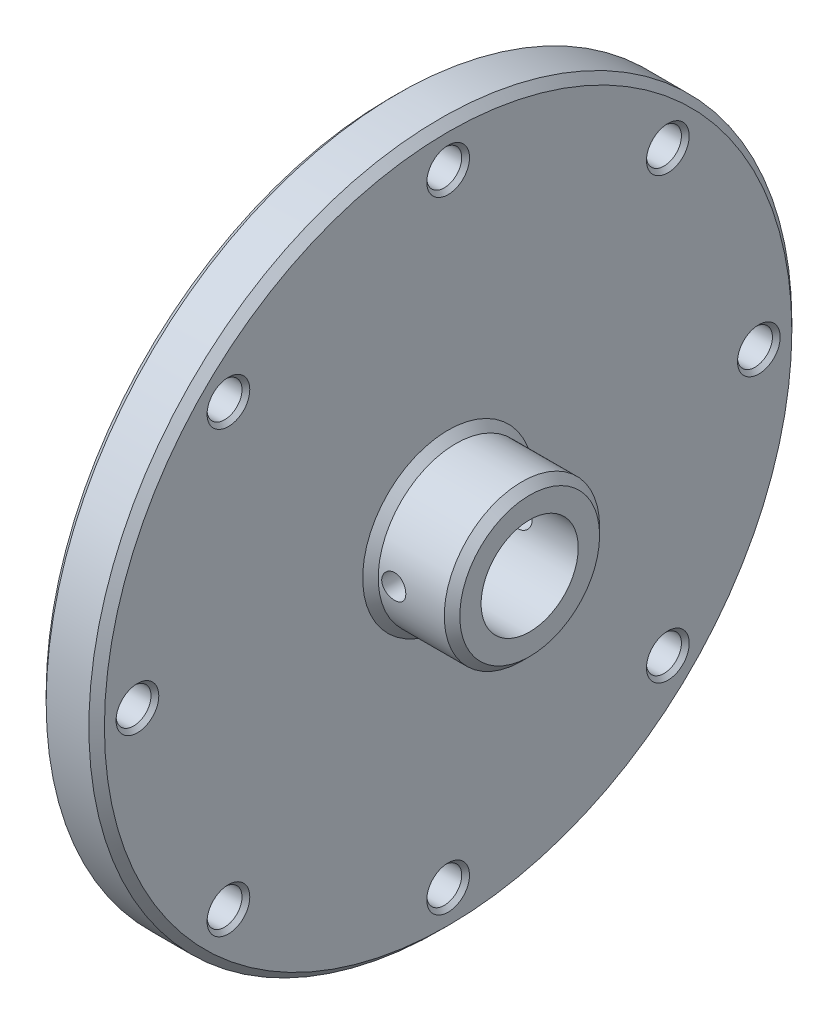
ISO-10303-21;
HEADER;
FILE_DESCRIPTION(('STEP AP214'),'2;1');
FILE_NAME('part.step','',(''),(''),'','','');
FILE_SCHEMA(('AUTOMOTIVE_DESIGN { 1 0 10303 214 1 1 1 1 }'));
ENDSEC;
DATA;
#1=APPLICATION_CONTEXT('core data for automotive mechanical design processes');
#2=APPLICATION_PROTOCOL_DEFINITION('international standard','automotive_design',2000,#1);
#3=PRODUCT_CONTEXT('',#1,'mechanical');
#4=PRODUCT('Part','Part','',(#3));
#5=PRODUCT_RELATED_PRODUCT_CATEGORY('part','',(#4));
#6=PRODUCT_DEFINITION_FORMATION('','',#4);
#7=PRODUCT_DEFINITION_CONTEXT('part definition',#1,'design');
#8=PRODUCT_DEFINITION('design','',#6,#7);
#9=PRODUCT_DEFINITION_SHAPE('','',#8);
#10=(LENGTH_UNIT() NAMED_UNIT(*) SI_UNIT(.MILLI.,.METRE.));
#11=(NAMED_UNIT(*) PLANE_ANGLE_UNIT() SI_UNIT($,.RADIAN.));
#12=(NAMED_UNIT(*) SI_UNIT($,.STERADIAN.) SOLID_ANGLE_UNIT());
#13=UNCERTAINTY_MEASURE_WITH_UNIT(LENGTH_MEASURE(1.E-05),#10,'distance_accuracy_value','');
#14=(GEOMETRIC_REPRESENTATION_CONTEXT(3) GLOBAL_UNCERTAINTY_ASSIGNED_CONTEXT((#13)) GLOBAL_UNIT_ASSIGNED_CONTEXT((#10,
#11,#12)) REPRESENTATION_CONTEXT('',''));
#15=CARTESIAN_POINT('',(0.,0.,0.));
#16=DIRECTION('',(0.,0.,1.));
#17=DIRECTION('',(1.,0.,0.));
#18=AXIS2_PLACEMENT_3D('',#15,#16,#17);
#19=CARTESIAN_POINT('',(-7.50000000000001,90.5,0.));
#20=DIRECTION('',(-1.,0.,0.));
#21=DIRECTION('',(0.,0.,1.));
#22=AXIS2_PLACEMENT_3D('',#19,#20,#21);
#23=PLANE('',#22);
#24=CARTESIAN_POINT('',(-7.50000000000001,56.5685424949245,-56.5685424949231));
#25=DIRECTION('',(1.,0.,0.));
#26=DIRECTION('',(0.,-0.707106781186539,-0.707106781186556));
#27=AXIS2_PLACEMENT_3D('',#24,#25,#26);
#28=CIRCLE('',#27,4.5);
#29=CARTESIAN_POINT('',(-7.50000000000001,56.5685424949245,-61.0685424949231));
#30=VERTEX_POINT('',#29);
#31=EDGE_CURVE('E136',#30,#30,#28,.T.);
#32=ORIENTED_EDGE('',*,*,#31,.T.);
#33=EDGE_LOOP('',(#32));
#34=FACE_BOUND('',#33,.T.);
#35=CARTESIAN_POINT('',(-7.50000000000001,8.37956006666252E-13,-80.));
#36=DIRECTION('',(1.,0.,0.));
#37=DIRECTION('',(0.,-1.,0.));
#38=AXIS2_PLACEMENT_3D('',#35,#36,#37);
#39=CIRCLE('',#38,4.5);
#40=CARTESIAN_POINT('',(-7.50000000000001,8.37956006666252E-13,-84.5));
#41=VERTEX_POINT('',#40);
#42=EDGE_CURVE('E137',#41,#41,#39,.T.);
#43=ORIENTED_EDGE('',*,*,#42,.T.);
#44=EDGE_LOOP('',(#43));
#45=FACE_BOUND('',#44,.T.);
#46=CARTESIAN_POINT('',(-7.50000000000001,-56.5685424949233,-56.5685424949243));
#47=DIRECTION('',(1.,0.,0.));
#48=DIRECTION('',(0.,-0.707106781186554,0.707106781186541));
#49=AXIS2_PLACEMENT_3D('',#46,#47,#48);
#50=CIRCLE('',#49,4.5);
#51=CARTESIAN_POINT('',(-7.50000000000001,-56.5685424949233,-61.0685424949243));
#52=VERTEX_POINT('',#51);
#53=EDGE_CURVE('E140',#52,#52,#50,.T.);
#54=ORIENTED_EDGE('',*,*,#53,.T.);
#55=EDGE_LOOP('',(#54));
#56=FACE_BOUND('',#55,.T.);
#57=CARTESIAN_POINT('',(-7.50000000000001,-80.,0.));
#58=DIRECTION('',(1.,0.,0.));
#59=DIRECTION('',(0.,0.,1.));
#60=AXIS2_PLACEMENT_3D('',#57,#58,#59);
#61=CIRCLE('',#60,4.5);
#62=CARTESIAN_POINT('',(-7.50000000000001,-80.,-4.5));
#63=VERTEX_POINT('',#62);
#64=EDGE_CURVE('E145',#63,#63,#61,.T.);
#65=ORIENTED_EDGE('',*,*,#64,.T.);
#66=EDGE_LOOP('',(#65));
#67=FACE_BOUND('',#66,.T.);
#68=CARTESIAN_POINT('',(-7.50000000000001,-56.5685424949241,56.5685424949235));
#69=DIRECTION('',(1.,0.,0.));
#70=DIRECTION('',(0.,0.707106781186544,0.707106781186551));
#71=AXIS2_PLACEMENT_3D('',#68,#69,#70);
#72=CIRCLE('',#71,4.5);
#73=CARTESIAN_POINT('',(-7.50000000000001,-56.5685424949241,52.0685424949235));
#74=VERTEX_POINT('',#73);
#75=EDGE_CURVE('E148',#74,#74,#72,.T.);
#76=ORIENTED_EDGE('',*,*,#75,.T.);
#77=EDGE_LOOP('',(#76));
#78=FACE_BOUND('',#77,.T.);
#79=CARTESIAN_POINT('',(-7.50000000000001,-2.79318668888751E-13,80.));
#80=DIRECTION('',(1.,0.,0.));
#81=DIRECTION('',(0.,1.,0.));
#82=AXIS2_PLACEMENT_3D('',#79,#80,#81);
#83=CIRCLE('',#82,4.5);
#84=CARTESIAN_POINT('',(-7.50000000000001,-2.79318668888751E-13,75.5));
#85=VERTEX_POINT('',#84);
#86=EDGE_CURVE('E151',#85,#85,#83,.T.);
#87=ORIENTED_EDGE('',*,*,#86,.T.);
#88=EDGE_LOOP('',(#87));
#89=FACE_BOUND('',#88,.T.);
#90=CARTESIAN_POINT('',(-7.50000000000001,56.5685424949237,56.5685424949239));
#91=DIRECTION('',(1.,0.,0.));
#92=DIRECTION('',(0.,0.707106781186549,-0.707106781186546));
#93=AXIS2_PLACEMENT_3D('',#90,#91,#92);
#94=CIRCLE('',#93,4.5);
#95=CARTESIAN_POINT('',(-7.50000000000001,56.5685424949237,52.0685424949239));
#96=VERTEX_POINT('',#95);
#97=EDGE_CURVE('E154',#96,#96,#94,.T.);
#98=ORIENTED_EDGE('',*,*,#97,.T.);
#99=EDGE_LOOP('',(#98));
#100=FACE_BOUND('',#99,.T.);
#101=CARTESIAN_POINT('',(-7.50000000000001,80.,0.));
#102=DIRECTION('',(1.,0.,0.));
#103=DIRECTION('',(0.,0.,-1.));
#104=AXIS2_PLACEMENT_3D('',#101,#102,#103);
#105=CIRCLE('',#104,4.5);
#106=CARTESIAN_POINT('',(-7.50000000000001,80.,-4.5));
#107=VERTEX_POINT('',#106);
#108=EDGE_CURVE('E157',#107,#107,#105,.T.);
#109=ORIENTED_EDGE('',*,*,#108,.T.);
#110=EDGE_LOOP('',(#109));
#111=FACE_BOUND('',#110,.T.);
#112=CARTESIAN_POINT('',(-7.50000000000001,0.,0.));
#113=DIRECTION('',(-1.,0.,0.));
#114=DIRECTION('',(0.,0.,1.));
#115=AXIS2_PLACEMENT_3D('',#112,#113,#114);
#116=CIRCLE('',#115,88.5);
#117=CARTESIAN_POINT('',(-7.50000000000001,0.,88.5));
#118=VERTEX_POINT('',#117);
#119=EDGE_CURVE('E229',#118,#118,#116,.T.);
#120=ORIENTED_EDGE('',*,*,#119,.T.);
#121=EDGE_LOOP('',(#120));
#122=FACE_BOUND('',#121,.T.);
#123=ADVANCED_FACE('F32',(#34,#45,#56,#67,#78,#89,#100,#111,#122),#23,.T.);
#124=CARTESIAN_POINT('',(-4.7168783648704,0.,0.));
#125=DIRECTION('',(1.,0.,0.));
#126=DIRECTION('',(0.,0.,-1.));
#127=AXIS2_PLACEMENT_3D('',#124,#125,#126);
#128=CONICAL_SURFACE('',#127,0.,1.04719755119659);
#129=CARTESIAN_POINT('',(2.5,0.,0.));
#130=DIRECTION('',(1.,0.,0.));
#131=DIRECTION('',(0.,0.,-1.));
#132=AXIS2_PLACEMENT_3D('',#129,#130,#131);
#133=CIRCLE('',#132,12.5);
#134=CARTESIAN_POINT('',(2.5,0.,-12.5));
#135=VERTEX_POINT('',#134);
#136=EDGE_CURVE('E213',#135,#135,#133,.T.);
#137=ORIENTED_EDGE('',*,*,#136,.T.);
#138=EDGE_LOOP('',(#137));
#139=FACE_BOUND('',#138,.T.);
#140=CARTESIAN_POINT('',(-4.7168783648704,0.,0.));
#141=VERTEX_POINT('',#140);
#142=VERTEX_LOOP('',#141);
#143=FACE_BOUND('',#142,.T.);
#144=ADVANCED_FACE('F42',(#139,#143),#128,.F.);
#145=CARTESIAN_POINT('',(37.8333178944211,0.,0.));
#146=DIRECTION('',(1.,0.,0.));
#147=DIRECTION('',(0.,0.,-1.));
#148=AXIS2_PLACEMENT_3D('',#145,#146,#147);
#149=CYLINDRICAL_SURFACE('',#148,12.5);
#150=CARTESIAN_POINT('',(10.4,0.,-12.5));
#151=CARTESIAN_POINT('',(10.4000048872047,-0.171321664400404,-12.4999970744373));
#152=CARTESIAN_POINT('',(10.4142499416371,-0.342698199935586,-12.4964427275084));
#153=CARTESIAN_POINT('',(10.4707702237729,-0.680542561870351,-12.4826080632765));
#154=CARTESIAN_POINT('',(10.5130616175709,-0.847007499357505,-12.4723238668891));
#155=CARTESIAN_POINT('',(10.6242364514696,-1.17010085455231,-12.4461687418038));
#156=CARTESIAN_POINT('',(10.6930882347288,-1.32674072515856,-12.4303044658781));
#157=CARTESIAN_POINT('',(10.8553187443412,-1.62624649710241,-12.394680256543));
#158=CARTESIAN_POINT('',(10.9486982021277,-1.7691119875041,-12.3749202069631));
#159=CARTESIAN_POINT('',(11.159335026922,-2.03991290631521,-12.3332026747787));
#160=CARTESIAN_POINT('',(11.276996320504,-2.1675290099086,-12.3112117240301));
#161=CARTESIAN_POINT('',(11.5319918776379,-2.40143368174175,-12.2677341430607));
#162=CARTESIAN_POINT('',(11.6693283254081,-2.50771987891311,-12.2462475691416));
#163=CARTESIAN_POINT('',(11.9622471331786,-2.69744315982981,-12.205874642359));
#164=CARTESIAN_POINT('',(12.1180664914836,-2.78052420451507,-12.1870308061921));
#165=CARTESIAN_POINT('',(12.4420026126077,-2.91918958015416,-12.1545645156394));
#166=CARTESIAN_POINT('',(12.6101174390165,-2.97477823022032,-12.1409412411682));
#167=CARTESIAN_POINT('',(12.9503641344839,-3.05579378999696,-12.1208023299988));
#168=CARTESIAN_POINT('',(13.1223512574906,-3.08179427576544,-12.114151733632));
#169=CARTESIAN_POINT('',(13.468364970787,-3.10468184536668,-12.1083071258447));
#170=CARTESIAN_POINT('',(13.6423912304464,-3.10157358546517,-12.1091119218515));
#171=CARTESIAN_POINT('',(13.9831563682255,-3.06678979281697,-12.1179657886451));
#172=CARTESIAN_POINT('',(14.1499700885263,-3.03579655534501,-12.1258418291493));
#173=CARTESIAN_POINT('',(14.4759532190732,-2.9472104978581,-12.1476751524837));
#174=CARTESIAN_POINT('',(14.635122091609,-2.88961580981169,-12.1616328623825));
#175=CARTESIAN_POINT('',(14.9431328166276,-2.74887729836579,-12.1942164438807));
#176=CARTESIAN_POINT('',(15.0918561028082,-2.66548486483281,-12.212887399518));
#177=CARTESIAN_POINT('',(15.3734433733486,-2.47569199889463,-12.2527681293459));
#178=CARTESIAN_POINT('',(15.5063046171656,-2.36928759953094,-12.2739783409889));
#179=CARTESIAN_POINT('',(15.7563076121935,-2.13295176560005,-12.3172772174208));
#180=CARTESIAN_POINT('',(15.8729040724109,-2.00244425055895,-12.3393738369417));
#181=CARTESIAN_POINT('',(16.0826587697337,-1.72346462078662,-12.3814190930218));
#182=CARTESIAN_POINT('',(16.1758163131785,-1.57499197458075,-12.4013676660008));
#183=CARTESIAN_POINT('',(16.3362444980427,-1.26352628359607,-12.436965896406));
#184=CARTESIAN_POINT('',(16.403427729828,-1.1004864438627,-12.4526009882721));
#185=CARTESIAN_POINT('',(16.50928185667,-0.764953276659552,-12.4777045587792));
#186=CARTESIAN_POINT('',(16.5479581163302,-0.592461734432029,-12.4871741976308));
#187=CARTESIAN_POINT('',(16.5948703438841,-0.247584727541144,-12.4987086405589));
#188=CARTESIAN_POINT('',(16.6038490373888,-0.0753061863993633,-12.5009540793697));
#189=CARTESIAN_POINT('',(16.5931467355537,0.268291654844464,-12.4983010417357));
#190=CARTESIAN_POINT('',(16.5734682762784,0.439611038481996,-12.4934031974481));
#191=CARTESIAN_POINT('',(16.5066227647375,0.773854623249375,-12.4771295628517));
#192=CARTESIAN_POINT('',(16.4598598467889,0.936864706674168,-12.4658490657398));
#193=CARTESIAN_POINT('',(16.3406335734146,1.25271883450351,-12.4380808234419));
#194=CARTESIAN_POINT('',(16.268167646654,1.40556185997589,-12.4215925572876));
#195=CARTESIAN_POINT('',(16.0981457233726,1.69970617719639,-12.3848041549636));
#196=CARTESIAN_POINT('',(16.0001723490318,1.84075831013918,-12.3644422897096));
#197=CARTESIAN_POINT('',(15.7824511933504,2.10468362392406,-12.3222644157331));
#198=CARTESIAN_POINT('',(15.6626997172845,2.22755371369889,-12.3004481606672));
#199=CARTESIAN_POINT('',(15.4013755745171,2.45467959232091,-12.2571718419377));
#200=CARTESIAN_POINT('',(15.2593461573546,2.55841478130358,-12.2357330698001));
#201=CARTESIAN_POINT('',(14.9594560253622,2.74057686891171,-12.1962272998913));
#202=CARTESIAN_POINT('',(14.801596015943,2.8190048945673,-12.1781601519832));
#203=CARTESIAN_POINT('',(14.4753760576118,2.9477445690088,-12.1476409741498));
#204=CARTESIAN_POINT('',(14.3070851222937,2.99822281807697,-12.1351557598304));
#205=CARTESIAN_POINT('',(13.9640492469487,3.07007327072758,-12.1171798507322));
#206=CARTESIAN_POINT('',(13.789305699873,3.09145171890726,-12.1116876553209));
#207=CARTESIAN_POINT('',(13.4436190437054,3.10417336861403,-12.108432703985));
#208=CARTESIAN_POINT('',(13.2727080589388,3.09634814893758,-12.1104559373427));
#209=CARTESIAN_POINT('',(12.9347240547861,3.05278480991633,-12.1215098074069));
#210=CARTESIAN_POINT('',(12.7676509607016,3.01704723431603,-12.1305403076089));
#211=CARTESIAN_POINT('',(12.4429730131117,2.91912445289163,-12.1544728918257));
#212=CARTESIAN_POINT('',(12.2853191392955,2.85709286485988,-12.1693408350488));
#213=CARTESIAN_POINT('',(11.9825448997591,2.70846488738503,-12.2032783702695));
#214=CARTESIAN_POINT('',(11.83742624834,2.62186514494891,-12.2223485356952));
#215=CARTESIAN_POINT('',(11.5598178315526,2.42394187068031,-12.2631540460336));
#216=CARTESIAN_POINT('',(11.427748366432,2.31204024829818,-12.2849452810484));
#217=CARTESIAN_POINT('',(11.1839911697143,2.06781935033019,-12.3284012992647));
#218=CARTESIAN_POINT('',(11.0723082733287,1.93549524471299,-12.3500660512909));
#219=CARTESIAN_POINT('',(10.8705643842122,1.65135189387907,-12.3912866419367));
#220=CARTESIAN_POINT('',(10.7809221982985,1.49922839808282,-12.4107982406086));
#221=CARTESIAN_POINT('',(10.6286262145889,1.18160190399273,-12.4450491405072));
#222=CARTESIAN_POINT('',(10.5659528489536,1.01610871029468,-12.4597918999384));
#223=CARTESIAN_POINT('',(10.4788052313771,0.709064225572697,-12.4806334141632));
#224=CARTESIAN_POINT('',(10.4493166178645,0.568990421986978,-12.4878463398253));
#225=CARTESIAN_POINT('',(10.4099126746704,0.285957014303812,-12.4975306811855));
#226=CARTESIAN_POINT('',(10.3999959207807,0.142997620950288,-12.5000024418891));
#227=CARTESIAN_POINT('',(10.4,0.,-12.5));
#228=B_SPLINE_CURVE_WITH_KNOTS('',3,(#150,#151,#152,#153,#154,#155,#156,#157,#158,#159,#160,
#161,#162,#163,#164,#165,#166,#167,#168,#169,#170,#171,#172,#173,#174,#175,#176,#177,#178,#179,
#180,#181,#182,#183,#184,#185,#186,#187,#188,#189,#190,#191,#192,#193,#194,#195,#196,#197,#198,
#199,#200,#201,#202,#203,#204,#205,#206,#207,#208,#209,#210,#211,#212,#213,#214,#215,#216,#217,
#218,#219,#220,#221,#222,#223,#224,#225,#226,#227),.UNSPECIFIED.,.T.,.F.,(4,2,2,2,2,2,2,2,2,2,2,
2,2,2,2,2,2,2,2,2,2,2,2,2,2,2,2,2,2,2,2,2,2,2,2,2,2,2,4),(0.,0.513441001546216,1.02717821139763,
1.54030498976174,2.05344707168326,2.57593534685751,3.09848167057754,3.62865286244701,
4.15874073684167,4.67836762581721,5.19791139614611,5.70507856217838,6.2122813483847,
6.72453284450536,7.23687271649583,7.7635798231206,8.29030251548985,8.81878263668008,
9.34716328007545,9.86222518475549,10.3772415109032,10.8847641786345,11.3923376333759,
11.9088047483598,12.4253595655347,12.9543766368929,13.4833701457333,14.0091755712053,
14.5348681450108,15.0457072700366,15.5565364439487,16.0644214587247,16.5723758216,
17.093381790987,17.6145111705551,18.1448871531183,18.6748776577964,19.103464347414,
19.532019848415),.UNSPECIFIED.);
#229=CARTESIAN_POINT('',(10.4,0.,-12.5));
#230=VERTEX_POINT('',#229);
#231=EDGE_CURVE('E167',#230,#230,#228,.T.);
#232=ORIENTED_EDGE('',*,*,#231,.F.);
#233=EDGE_LOOP('',(#232));
#234=FACE_BOUND('',#233,.T.);
#235=CARTESIAN_POINT('',(16.6,0.,12.5));
#236=CARTESIAN_POINT('',(16.5999951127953,-0.171321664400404,12.4999970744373));
#237=CARTESIAN_POINT('',(16.5857500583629,-0.342698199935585,12.4964427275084));
#238=CARTESIAN_POINT('',(16.5292297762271,-0.68054256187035,12.4826080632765));
#239=CARTESIAN_POINT('',(16.4869383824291,-0.847007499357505,12.4723238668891));
#240=CARTESIAN_POINT('',(16.3757635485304,-1.17010085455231,12.4461687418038));
#241=CARTESIAN_POINT('',(16.3069117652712,-1.32674072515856,12.4303044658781));
#242=CARTESIAN_POINT('',(16.1446812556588,-1.62624649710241,12.394680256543));
#243=CARTESIAN_POINT('',(16.0513017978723,-1.76911198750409,12.3749202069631));
#244=CARTESIAN_POINT('',(15.840664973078,-2.03991290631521,12.3332026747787));
#245=CARTESIAN_POINT('',(15.723003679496,-2.1675290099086,12.3112117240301));
#246=CARTESIAN_POINT('',(15.468008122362,-2.40143368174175,12.2677341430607));
#247=CARTESIAN_POINT('',(15.3306716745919,-2.50771987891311,12.2462475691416));
#248=CARTESIAN_POINT('',(15.0377528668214,-2.69744315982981,12.205874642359));
#249=CARTESIAN_POINT('',(14.8819335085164,-2.78052420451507,12.1870308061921));
#250=CARTESIAN_POINT('',(14.5579973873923,-2.91918958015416,12.1545645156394));
#251=CARTESIAN_POINT('',(14.3898825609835,-2.97477823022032,12.1409412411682));
#252=CARTESIAN_POINT('',(14.0496358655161,-3.05579378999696,12.1208023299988));
#253=CARTESIAN_POINT('',(13.8776487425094,-3.08179427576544,12.114151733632));
#254=CARTESIAN_POINT('',(13.531635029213,-3.10468184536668,12.1083071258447));
#255=CARTESIAN_POINT('',(13.3576087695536,-3.10157358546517,12.1091119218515));
#256=CARTESIAN_POINT('',(13.0168436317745,-3.06678979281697,12.1179657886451));
#257=CARTESIAN_POINT('',(12.8500299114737,-3.03579655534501,12.1258418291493));
#258=CARTESIAN_POINT('',(12.5240467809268,-2.9472104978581,12.1476751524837));
#259=CARTESIAN_POINT('',(12.364877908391,-2.88961580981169,12.1616328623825));
#260=CARTESIAN_POINT('',(12.0568671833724,-2.74887729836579,12.1942164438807));
#261=CARTESIAN_POINT('',(11.9081438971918,-2.66548486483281,12.212887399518));
#262=CARTESIAN_POINT('',(11.6265566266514,-2.47569199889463,12.2527681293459));
#263=CARTESIAN_POINT('',(11.4936953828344,-2.36928759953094,12.2739783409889));
#264=CARTESIAN_POINT('',(11.2436923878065,-2.13295176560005,12.3172772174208));
#265=CARTESIAN_POINT('',(11.1270959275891,-2.00244425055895,12.3393738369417));
#266=CARTESIAN_POINT('',(10.9173412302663,-1.72346462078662,12.3814190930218));
#267=CARTESIAN_POINT('',(10.8241836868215,-1.57499197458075,12.4013676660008));
#268=CARTESIAN_POINT('',(10.6637555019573,-1.26352628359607,12.436965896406));
#269=CARTESIAN_POINT('',(10.596572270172,-1.10048644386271,12.4526009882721));
#270=CARTESIAN_POINT('',(10.49071814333,-0.764953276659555,12.4777045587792));
#271=CARTESIAN_POINT('',(10.4520418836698,-0.59246173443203,12.4871741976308));
#272=CARTESIAN_POINT('',(10.4051296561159,-0.247584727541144,12.4987086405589));
#273=CARTESIAN_POINT('',(10.3961509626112,-0.0753061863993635,12.5009540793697));
#274=CARTESIAN_POINT('',(10.4068532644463,0.268291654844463,12.4983010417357));
#275=CARTESIAN_POINT('',(10.4265317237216,0.439611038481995,12.4934031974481));
#276=CARTESIAN_POINT('',(10.4933772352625,0.773854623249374,12.4771295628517));
#277=CARTESIAN_POINT('',(10.5401401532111,0.936864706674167,12.4658490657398));
#278=CARTESIAN_POINT('',(10.6593664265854,1.25271883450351,12.4380808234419));
#279=CARTESIAN_POINT('',(10.731832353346,1.40556185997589,12.4215925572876));
#280=CARTESIAN_POINT('',(10.9018542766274,1.69970617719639,12.3848041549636));
#281=CARTESIAN_POINT('',(10.9998276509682,1.84075831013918,12.3644422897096));
#282=CARTESIAN_POINT('',(11.2175488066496,2.10468362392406,12.3222644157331));
#283=CARTESIAN_POINT('',(11.3373002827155,2.22755371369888,12.3004481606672));
#284=CARTESIAN_POINT('',(11.5986244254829,2.45467959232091,12.2571718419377));
#285=CARTESIAN_POINT('',(11.7406538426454,2.55841478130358,12.2357330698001));
#286=CARTESIAN_POINT('',(12.0405439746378,2.74057686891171,12.1962272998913));
#287=CARTESIAN_POINT('',(12.198403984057,2.8190048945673,12.1781601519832));
#288=CARTESIAN_POINT('',(12.5246239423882,2.9477445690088,12.1476409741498));
#289=CARTESIAN_POINT('',(12.6929148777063,2.99822281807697,12.1351557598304));
#290=CARTESIAN_POINT('',(13.0359507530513,3.07007327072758,12.1171798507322));
#291=CARTESIAN_POINT('',(13.210694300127,3.09145171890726,12.1116876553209));
#292=CARTESIAN_POINT('',(13.5563809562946,3.10417336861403,12.108432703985));
#293=CARTESIAN_POINT('',(13.7272919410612,3.09634814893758,12.1104559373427));
#294=CARTESIAN_POINT('',(14.0652759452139,3.05278480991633,12.1215098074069));
#295=CARTESIAN_POINT('',(14.2323490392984,3.01704723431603,12.1305403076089));
#296=CARTESIAN_POINT('',(14.5570269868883,2.91912445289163,12.1544728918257));
#297=CARTESIAN_POINT('',(14.7146808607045,2.85709286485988,12.1693408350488));
#298=CARTESIAN_POINT('',(15.0174551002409,2.70846488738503,12.2032783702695));
#299=CARTESIAN_POINT('',(15.16257375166,2.62186514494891,12.2223485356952));
#300=CARTESIAN_POINT('',(15.4401821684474,2.42394187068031,12.2631540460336));
#301=CARTESIAN_POINT('',(15.572251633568,2.31204024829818,12.2849452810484));
#302=CARTESIAN_POINT('',(15.8160088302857,2.06781935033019,12.3284012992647));
#303=CARTESIAN_POINT('',(15.9276917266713,1.93549524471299,12.3500660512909));
#304=CARTESIAN_POINT('',(16.1294356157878,1.65135189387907,12.3912866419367));
#305=CARTESIAN_POINT('',(16.2190778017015,1.49922839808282,12.4107982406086));
#306=CARTESIAN_POINT('',(16.3713737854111,1.18160190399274,12.4450491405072));
#307=CARTESIAN_POINT('',(16.4340471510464,1.01610871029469,12.4597918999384));
#308=CARTESIAN_POINT('',(16.5211947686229,0.709064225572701,12.4806334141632));
#309=CARTESIAN_POINT('',(16.5506833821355,0.56899042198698,12.4878463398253));
#310=CARTESIAN_POINT('',(16.5900873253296,0.285957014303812,12.4975306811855));
#311=CARTESIAN_POINT('',(16.6000040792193,0.142997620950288,12.5000024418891));
#312=CARTESIAN_POINT('',(16.6,0.,12.5));
#313=B_SPLINE_CURVE_WITH_KNOTS('',3,(#235,#236,#237,#238,#239,#240,#241,#242,#243,#244,#245,
#246,#247,#248,#249,#250,#251,#252,#253,#254,#255,#256,#257,#258,#259,#260,#261,#262,#263,#264,
#265,#266,#267,#268,#269,#270,#271,#272,#273,#274,#275,#276,#277,#278,#279,#280,#281,#282,#283,
#284,#285,#286,#287,#288,#289,#290,#291,#292,#293,#294,#295,#296,#297,#298,#299,#300,#301,#302,
#303,#304,#305,#306,#307,#308,#309,#310,#311,#312),.UNSPECIFIED.,.T.,.F.,(4,2,2,2,2,2,2,2,2,2,2,
2,2,2,2,2,2,2,2,2,2,2,2,2,2,2,2,2,2,2,2,2,2,2,2,2,2,2,4),(0.,0.513441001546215,1.02717821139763,
1.54030498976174,2.05344707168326,2.57593534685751,3.09848167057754,3.62865286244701,
4.15874073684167,4.67836762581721,5.19791139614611,5.70507856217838,6.2122813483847,
6.72453284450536,7.23687271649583,7.7635798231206,8.29030251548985,8.81878263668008,
9.34716328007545,9.86222518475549,10.3772415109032,10.8847641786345,11.3923376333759,
11.9088047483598,12.4253595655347,12.9543766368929,13.4833701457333,14.0091755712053,
14.5348681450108,15.0457072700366,15.5565364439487,16.0644214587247,16.5723758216,
17.093381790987,17.6145111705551,18.1448871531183,18.6748776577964,19.103464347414,
19.532019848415),.UNSPECIFIED.);
#314=CARTESIAN_POINT('',(16.6,0.,12.5));
#315=VERTEX_POINT('',#314);
#316=EDGE_CURVE('E161',#315,#315,#313,.T.);
#317=ORIENTED_EDGE('',*,*,#316,.F.);
#318=EDGE_LOOP('',(#317));
#319=FACE_BOUND('',#318,.T.);
#320=CARTESIAN_POINT('',(28.5,0.,0.));
#321=DIRECTION('',(1.,0.,0.));
#322=DIRECTION('',(0.,0.,-1.));
#323=AXIS2_PLACEMENT_3D('',#320,#321,#322);
#324=CIRCLE('',#323,12.5);
#325=CARTESIAN_POINT('',(28.5,0.,-12.5));
#326=VERTEX_POINT('',#325);
#327=EDGE_CURVE('E211',#326,#326,#324,.T.);
#328=ORIENTED_EDGE('',*,*,#327,.T.);
#329=EDGE_LOOP('',(#328));
#330=FACE_BOUND('',#329,.T.);
#331=ORIENTED_EDGE('',*,*,#136,.F.);
#332=EDGE_LOOP('',(#331));
#333=FACE_BOUND('',#332,.T.);
#334=ADVANCED_FACE('F44',(#234,#319,#330,#333),#149,.F.);
#335=CARTESIAN_POINT('',(28.5,20.,0.));
#336=DIRECTION('',(1.,0.,0.));
#337=DIRECTION('',(0.,0.,-1.));
#338=AXIS2_PLACEMENT_3D('',#335,#336,#337);
#339=PLANE('',#338);
#340=CARTESIAN_POINT('',(28.5,0.,0.));
#341=DIRECTION('',(1.,0.,0.));
#342=DIRECTION('',(0.,0.,-1.));
#343=AXIS2_PLACEMENT_3D('',#340,#341,#342);
#344=CIRCLE('',#343,18.);
#345=CARTESIAN_POINT('',(28.5,0.,-18.));
#346=VERTEX_POINT('',#345);
#347=EDGE_CURVE('E208',#346,#346,#344,.T.);
#348=ORIENTED_EDGE('',*,*,#347,.T.);
#349=EDGE_LOOP('',(#348));
#350=FACE_BOUND('',#349,.T.);
#351=ORIENTED_EDGE('',*,*,#327,.F.);
#352=EDGE_LOOP('',(#351));
#353=FACE_BOUND('',#352,.T.);
#354=ADVANCED_FACE('F51',(#350,#353),#339,.T.);
#355=CARTESIAN_POINT('',(37.8333178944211,0.,0.));
#356=DIRECTION('',(1.,0.,0.));
#357=DIRECTION('',(0.,0.,-1.));
#358=AXIS2_PLACEMENT_3D('',#355,#356,#357);
#359=CYLINDRICAL_SURFACE('',#358,20.);
#360=CARTESIAN_POINT('',(10.4,0.,-20.));
#361=CARTESIAN_POINT('',(10.4000070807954,0.173016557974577,-19.9999971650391));
#362=CARTESIAN_POINT('',(10.4145334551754,0.34613178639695,-19.9977314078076));
#363=CARTESIAN_POINT('',(10.4722377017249,0.687518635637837,-19.9889109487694));
#364=CARTESIAN_POINT('',(10.5154430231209,0.855785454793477,-19.9823521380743));
#365=CARTESIAN_POINT('',(10.6291791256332,1.18248593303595,-19.9656822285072));
#366=CARTESIAN_POINT('',(10.6996887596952,1.34092709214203,-19.9555738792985));
#367=CARTESIAN_POINT('',(10.865979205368,1.64370610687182,-19.9329202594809));
#368=CARTESIAN_POINT('',(10.9617566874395,1.78804581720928,-19.9203753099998));
#369=CARTESIAN_POINT('',(11.1767126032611,2.05974845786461,-19.8941255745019));
#370=CARTESIAN_POINT('',(11.2960598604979,2.18697707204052,-19.8804128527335));
#371=CARTESIAN_POINT('',(11.5544041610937,2.4196867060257,-19.85343479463));
#372=CARTESIAN_POINT('',(11.6934023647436,2.52516644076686,-19.8401694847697));
#373=CARTESIAN_POINT('',(11.9880113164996,2.71191152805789,-19.8155112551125));
#374=CARTESIAN_POINT('',(12.1437059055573,2.79304608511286,-19.8041285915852));
#375=CARTESIAN_POINT('',(12.4667188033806,2.92796168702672,-19.7846333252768));
#376=CARTESIAN_POINT('',(12.6340364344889,2.98174432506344,-19.7765205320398));
#377=CARTESIAN_POINT('',(12.9741299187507,3.06001047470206,-19.7645618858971));
#378=CARTESIAN_POINT('',(13.146851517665,3.08472451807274,-19.7606824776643));
#379=CARTESIAN_POINT('',(13.4940304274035,3.1048662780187,-19.7575280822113));
#380=CARTESIAN_POINT('',(13.668487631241,3.10029578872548,-19.758252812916));
#381=CARTESIAN_POINT('',(14.0125521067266,3.06218643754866,-19.7641941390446));
#382=CARTESIAN_POINT('',(14.1821886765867,3.02890496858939,-19.7693708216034));
#383=CARTESIAN_POINT('',(14.5134404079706,2.93472161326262,-19.783570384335));
#384=CARTESIAN_POINT('',(14.6750553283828,2.87381889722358,-19.7925933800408));
#385=CARTESIAN_POINT('',(14.9864555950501,2.72585610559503,-19.8135127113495));
#386=CARTESIAN_POINT('',(15.1361886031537,2.63868762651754,-19.8254209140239));
#387=CARTESIAN_POINT('',(15.4189999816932,2.44074483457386,-19.8507604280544));
#388=CARTESIAN_POINT('',(15.5520771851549,2.32996886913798,-19.8641918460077));
#389=CARTESIAN_POINT('',(15.7992906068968,2.0865457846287,-19.8912404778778));
#390=CARTESIAN_POINT('',(15.9132091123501,1.95367749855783,-19.9048581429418));
#391=CARTESIAN_POINT('',(16.1171645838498,1.67059352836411,-19.9306117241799));
#392=CARTESIAN_POINT('',(16.2072014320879,1.52037775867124,-19.9427476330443));
#393=CARTESIAN_POINT('',(16.3608514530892,1.20666955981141,-19.9641842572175));
#394=CARTESIAN_POINT('',(16.4244471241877,1.04316842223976,-19.973483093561));
#395=CARTESIAN_POINT('',(16.5232165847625,0.707630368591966,-19.9881823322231));
#396=CARTESIAN_POINT('',(16.5583924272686,0.535594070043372,-19.9935830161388));
#397=CARTESIAN_POINT('',(16.5990325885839,0.18974745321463,-19.999839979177));
#398=CARTESIAN_POINT('',(16.6047960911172,0.0159730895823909,-20.0007420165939));
#399=CARTESIAN_POINT('',(16.5872431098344,-0.330059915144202,-19.9980248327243));
#400=CARTESIAN_POINT('',(16.5639275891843,-0.502318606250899,-19.9944057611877));
#401=CARTESIAN_POINT('',(16.4891272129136,-0.839519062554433,-19.9830813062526));
#402=CARTESIAN_POINT('',(16.4377888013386,-1.00449408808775,-19.9753971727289));
#403=CARTESIAN_POINT('',(16.308554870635,-1.32349525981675,-19.9568011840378));
#404=CARTESIAN_POINT('',(16.2306580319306,-1.4775208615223,-19.9458891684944));
#405=CARTESIAN_POINT('',(16.0498213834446,-1.7715619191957,-19.9219357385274));
#406=CARTESIAN_POINT('',(15.9466926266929,-1.91145985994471,-19.9088785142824));
#407=CARTESIAN_POINT('',(15.7185817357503,-2.17206987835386,-19.8821353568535));
#408=CARTESIAN_POINT('',(15.5935982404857,-2.29278076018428,-19.8684493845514));
#409=CARTESIAN_POINT('',(15.3239908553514,-2.51268466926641,-19.8418452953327));
#410=CARTESIAN_POINT('',(15.179202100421,-2.61167667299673,-19.8289350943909));
#411=CARTESIAN_POINT('',(14.8748754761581,-2.78393359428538,-19.805486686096));
#412=CARTESIAN_POINT('',(14.7153380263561,-2.85719924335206,-19.7949484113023));
#413=CARTESIAN_POINT('',(14.3866312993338,-2.97561529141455,-19.7774949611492));
#414=CARTESIAN_POINT('',(14.2175002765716,-3.02086981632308,-19.7705663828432));
#415=CARTESIAN_POINT('',(13.8739224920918,-3.08230938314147,-19.7610817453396));
#416=CARTESIAN_POINT('',(13.6994761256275,-3.09849658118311,-19.7585253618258));
#417=CARTESIAN_POINT('',(13.3522242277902,-3.10128813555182,-19.7580872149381));
#418=CARTESIAN_POINT('',(13.17942121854,-3.08820865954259,-19.7601554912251));
#419=CARTESIAN_POINT('',(12.8385047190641,-3.03351744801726,-19.7686247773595));
#420=CARTESIAN_POINT('',(12.6703912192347,-2.99190577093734,-19.7750257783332));
#421=CARTESIAN_POINT('',(12.3437235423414,-2.88144589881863,-19.791421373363));
#422=CARTESIAN_POINT('',(12.1851612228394,-2.81262129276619,-19.801412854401));
#423=CARTESIAN_POINT('',(11.8817828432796,-2.64972096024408,-19.8238671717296));
#424=CARTESIAN_POINT('',(11.7369673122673,-2.55564426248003,-19.836330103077));
#425=CARTESIAN_POINT('',(11.4635894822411,-2.34376738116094,-19.862483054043));
#426=CARTESIAN_POINT('',(11.3352093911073,-2.22573346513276,-19.876184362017));
#427=CARTESIAN_POINT('',(11.09996736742,-1.96978661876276,-19.9031772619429));
#428=CARTESIAN_POINT('',(10.9931104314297,-1.8318690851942,-19.9164687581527));
#429=CARTESIAN_POINT('',(10.8033805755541,-1.53910930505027,-19.9412344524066));
#430=CARTESIAN_POINT('',(10.7206528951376,-1.38417199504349,-19.9526974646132));
#431=CARTESIAN_POINT('',(10.5825209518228,-1.06249346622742,-19.9724052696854));
#432=CARTESIAN_POINT('',(10.5270887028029,-0.895764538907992,-19.9806533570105));
#433=CARTESIAN_POINT('',(10.4575400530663,-0.606929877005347,-19.9911430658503));
#434=CARTESIAN_POINT('',(10.4359959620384,-0.486597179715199,-19.9944471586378));
#435=CARTESIAN_POINT('',(10.4072235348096,-0.244192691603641,-19.9988766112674));
#436=CARTESIAN_POINT('',(10.3999950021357,-0.122120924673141,-20.000002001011));
#437=CARTESIAN_POINT('',(10.4,0.,-20.));
#438=B_SPLINE_CURVE_WITH_KNOTS('',3,(#360,#361,#362,#363,#364,#365,#366,#367,#368,#369,#370,
#371,#372,#373,#374,#375,#376,#377,#378,#379,#380,#381,#382,#383,#384,#385,#386,#387,#388,#389,
#390,#391,#392,#393,#394,#395,#396,#397,#398,#399,#400,#401,#402,#403,#404,#405,#406,#407,#408,
#409,#410,#411,#412,#413,#414,#415,#416,#417,#418,#419,#420,#421,#422,#423,#424,#425,#426,#427,
#428,#429,#430,#431,#432,#433,#434,#435,#436,#437),.UNSPECIFIED.,.T.,.F.,(4,2,2,2,2,2,2,2,2,2,2,
2,2,2,2,2,2,2,2,2,2,2,2,2,2,2,2,2,2,2,2,2,2,2,2,2,2,2,4),(0.,0.518603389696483,1.03770386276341,
1.55640309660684,2.07503401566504,2.59752406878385,3.12004498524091,3.64532487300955,
4.17057416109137,4.69162919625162,5.21265230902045,5.72905244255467,6.24546808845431,
6.76404496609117,7.28265815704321,7.80681594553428,8.33097631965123,8.85548309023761,
9.3799519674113,9.89907513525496,10.4181811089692,10.9345999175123,11.4510443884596,
11.9714813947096,12.4919508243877,13.0170514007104,13.5421370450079,14.0652588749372,
14.5883418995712,15.105801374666,15.6232597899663,16.1402706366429,16.6573013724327,
17.1796423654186,17.7021044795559,18.2276494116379,18.7526543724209,19.1187071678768,
19.4847549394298),.UNSPECIFIED.);
#439=CARTESIAN_POINT('',(10.4,0.,-20.));
#440=VERTEX_POINT('',#439);
#441=EDGE_CURVE('E168',#440,#440,#438,.T.);
#442=ORIENTED_EDGE('',*,*,#441,.F.);
#443=EDGE_LOOP('',(#442));
#444=FACE_BOUND('',#443,.T.);
#445=CARTESIAN_POINT('',(16.6,0.,20.));
#446=CARTESIAN_POINT('',(16.5999929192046,0.173016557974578,19.9999971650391));
#447=CARTESIAN_POINT('',(16.5854665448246,0.34613178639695,19.9977314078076));
#448=CARTESIAN_POINT('',(16.5277622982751,0.687518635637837,19.9889109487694));
#449=CARTESIAN_POINT('',(16.4845569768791,0.855785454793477,19.9823521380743));
#450=CARTESIAN_POINT('',(16.3708208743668,1.18248593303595,19.9656822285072));
#451=CARTESIAN_POINT('',(16.3003112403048,1.34092709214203,19.9555738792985));
#452=CARTESIAN_POINT('',(16.134020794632,1.64370610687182,19.9329202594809));
#453=CARTESIAN_POINT('',(16.0382433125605,1.78804581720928,19.9203753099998));
#454=CARTESIAN_POINT('',(15.8232873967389,2.05974845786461,19.8941255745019));
#455=CARTESIAN_POINT('',(15.7039401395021,2.18697707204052,19.8804128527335));
#456=CARTESIAN_POINT('',(15.4455958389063,2.4196867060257,19.85343479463));
#457=CARTESIAN_POINT('',(15.3065976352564,2.52516644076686,19.8401694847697));
#458=CARTESIAN_POINT('',(15.0119886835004,2.71191152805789,19.8155112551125));
#459=CARTESIAN_POINT('',(14.8562940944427,2.79304608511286,19.8041285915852));
#460=CARTESIAN_POINT('',(14.5332811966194,2.92796168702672,19.7846333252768));
#461=CARTESIAN_POINT('',(14.3659635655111,2.98174432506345,19.7765205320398));
#462=CARTESIAN_POINT('',(14.0258700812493,3.06001047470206,19.7645618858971));
#463=CARTESIAN_POINT('',(13.853148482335,3.08472451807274,19.7606824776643));
#464=CARTESIAN_POINT('',(13.5059695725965,3.1048662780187,19.7575280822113));
#465=CARTESIAN_POINT('',(13.331512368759,3.10029578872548,19.758252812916));
#466=CARTESIAN_POINT('',(12.9874478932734,3.06218643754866,19.7641941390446));
#467=CARTESIAN_POINT('',(12.8178113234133,3.02890496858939,19.7693708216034));
#468=CARTESIAN_POINT('',(12.4865595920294,2.93472161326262,19.783570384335));
#469=CARTESIAN_POINT('',(12.3249446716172,2.87381889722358,19.7925933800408));
#470=CARTESIAN_POINT('',(12.0135444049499,2.72585610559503,19.8135127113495));
#471=CARTESIAN_POINT('',(11.8638113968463,2.63868762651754,19.8254209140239));
#472=CARTESIAN_POINT('',(11.5810000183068,2.44074483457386,19.8507604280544));
#473=CARTESIAN_POINT('',(11.4479228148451,2.32996886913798,19.8641918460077));
#474=CARTESIAN_POINT('',(11.2007093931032,2.0865457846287,19.8912404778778));
#475=CARTESIAN_POINT('',(11.0867908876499,1.95367749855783,19.9048581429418));
#476=CARTESIAN_POINT('',(10.8828354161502,1.67059352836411,19.9306117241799));
#477=CARTESIAN_POINT('',(10.7927985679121,1.52037775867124,19.9427476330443));
#478=CARTESIAN_POINT('',(10.6391485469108,1.20666955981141,19.9641842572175));
#479=CARTESIAN_POINT('',(10.5755528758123,1.04316842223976,19.973483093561));
#480=CARTESIAN_POINT('',(10.4767834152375,0.707630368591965,19.9881823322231));
#481=CARTESIAN_POINT('',(10.4416075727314,0.535594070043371,19.9935830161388));
#482=CARTESIAN_POINT('',(10.4009674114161,0.189747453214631,19.999839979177));
#483=CARTESIAN_POINT('',(10.3952039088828,0.015973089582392,20.0007420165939));
#484=CARTESIAN_POINT('',(10.4127568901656,-0.330059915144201,19.9980248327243));
#485=CARTESIAN_POINT('',(10.4360724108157,-0.502318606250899,19.9944057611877));
#486=CARTESIAN_POINT('',(10.5108727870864,-0.839519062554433,19.9830813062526));
#487=CARTESIAN_POINT('',(10.5622111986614,-1.00449408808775,19.9753971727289));
#488=CARTESIAN_POINT('',(10.691445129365,-1.32349525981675,19.9568011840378));
#489=CARTESIAN_POINT('',(10.7693419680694,-1.4775208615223,19.9458891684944));
#490=CARTESIAN_POINT('',(10.9501786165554,-1.7715619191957,19.9219357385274));
#491=CARTESIAN_POINT('',(11.053307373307,-1.91145985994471,19.9088785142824));
#492=CARTESIAN_POINT('',(11.2814182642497,-2.17206987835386,19.8821353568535));
#493=CARTESIAN_POINT('',(11.4064017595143,-2.29278076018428,19.8684493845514));
#494=CARTESIAN_POINT('',(11.6760091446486,-2.51268466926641,19.8418452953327));
#495=CARTESIAN_POINT('',(11.820797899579,-2.61167667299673,19.8289350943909));
#496=CARTESIAN_POINT('',(12.1251245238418,-2.78393359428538,19.805486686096));
#497=CARTESIAN_POINT('',(12.2846619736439,-2.85719924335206,19.7949484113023));
#498=CARTESIAN_POINT('',(12.6133687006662,-2.97561529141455,19.7774949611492));
#499=CARTESIAN_POINT('',(12.7824997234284,-3.02086981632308,19.7705663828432));
#500=CARTESIAN_POINT('',(13.1260775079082,-3.08230938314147,19.7610817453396));
#501=CARTESIAN_POINT('',(13.3005238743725,-3.09849658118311,19.7585253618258));
#502=CARTESIAN_POINT('',(13.6477757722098,-3.10128813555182,19.7580872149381));
#503=CARTESIAN_POINT('',(13.82057878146,-3.08820865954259,19.7601554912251));
#504=CARTESIAN_POINT('',(14.1614952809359,-3.03351744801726,19.7686247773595));
#505=CARTESIAN_POINT('',(14.3296087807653,-2.99190577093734,19.7750257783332));
#506=CARTESIAN_POINT('',(14.6562764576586,-2.88144589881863,19.791421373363));
#507=CARTESIAN_POINT('',(14.8148387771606,-2.81262129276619,19.801412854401));
#508=CARTESIAN_POINT('',(15.1182171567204,-2.64972096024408,19.8238671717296));
#509=CARTESIAN_POINT('',(15.2630326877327,-2.55564426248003,19.836330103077));
#510=CARTESIAN_POINT('',(15.5364105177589,-2.34376738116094,19.862483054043));
#511=CARTESIAN_POINT('',(15.6647906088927,-2.22573346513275,19.876184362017));
#512=CARTESIAN_POINT('',(15.90003263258,-1.96978661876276,19.9031772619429));
#513=CARTESIAN_POINT('',(16.0068895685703,-1.8318690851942,19.9164687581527));
#514=CARTESIAN_POINT('',(16.1966194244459,-1.53910930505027,19.9412344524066));
#515=CARTESIAN_POINT('',(16.2793471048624,-1.38417199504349,19.9526974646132));
#516=CARTESIAN_POINT('',(16.4174790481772,-1.06249346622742,19.9724052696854));
#517=CARTESIAN_POINT('',(16.4729112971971,-0.895764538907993,19.9806533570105));
#518=CARTESIAN_POINT('',(16.5424599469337,-0.606929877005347,19.9911430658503));
#519=CARTESIAN_POINT('',(16.5640040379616,-0.486597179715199,19.9944471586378));
#520=CARTESIAN_POINT('',(16.5927764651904,-0.244192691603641,19.9988766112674));
#521=CARTESIAN_POINT('',(16.6000049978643,-0.122120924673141,20.000002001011));
#522=CARTESIAN_POINT('',(16.6,0.,20.));
#523=B_SPLINE_CURVE_WITH_KNOTS('',3,(#445,#446,#447,#448,#449,#450,#451,#452,#453,#454,#455,
#456,#457,#458,#459,#460,#461,#462,#463,#464,#465,#466,#467,#468,#469,#470,#471,#472,#473,#474,
#475,#476,#477,#478,#479,#480,#481,#482,#483,#484,#485,#486,#487,#488,#489,#490,#491,#492,#493,
#494,#495,#496,#497,#498,#499,#500,#501,#502,#503,#504,#505,#506,#507,#508,#509,#510,#511,#512,
#513,#514,#515,#516,#517,#518,#519,#520,#521,#522),.UNSPECIFIED.,.T.,.F.,(4,2,2,2,2,2,2,2,2,2,2,
2,2,2,2,2,2,2,2,2,2,2,2,2,2,2,2,2,2,2,2,2,2,2,2,2,2,2,4),(0.,0.518603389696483,1.03770386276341,
1.55640309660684,2.07503401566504,2.59752406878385,3.12004498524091,3.64532487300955,
4.17057416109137,4.69162919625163,5.21265230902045,5.72905244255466,6.24546808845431,
6.76404496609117,7.28265815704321,7.80681594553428,8.33097631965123,8.85548309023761,
9.3799519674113,9.89907513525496,10.4181811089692,10.9345999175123,11.4510443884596,
11.9714813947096,12.4919508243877,13.0170514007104,13.5421370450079,14.0652588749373,
14.5883418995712,15.105801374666,15.6232597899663,16.1402706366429,16.6573013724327,
17.1796423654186,17.7021044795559,18.2276494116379,18.7526543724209,19.1187071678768,
19.4847549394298),.UNSPECIFIED.);
#524=CARTESIAN_POINT('',(16.6,0.,20.));
#525=VERTEX_POINT('',#524);
#526=EDGE_CURVE('E160',#525,#525,#523,.T.);
#527=ORIENTED_EDGE('',*,*,#526,.F.);
#528=EDGE_LOOP('',(#527));
#529=FACE_BOUND('',#528,.T.);
#530=CARTESIAN_POINT('',(9.50000000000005,0.,0.));
#531=DIRECTION('',(1.,0.,0.));
#532=DIRECTION('',(0.,0.,-1.));
#533=AXIS2_PLACEMENT_3D('',#530,#531,#532);
#534=CIRCLE('',#533,20.);
#535=CARTESIAN_POINT('',(9.50000000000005,0.,-20.));
#536=VERTEX_POINT('',#535);
#537=EDGE_CURVE('E235',#536,#536,#534,.T.);
#538=ORIENTED_EDGE('',*,*,#537,.T.);
#539=EDGE_LOOP('',(#538));
#540=FACE_BOUND('',#539,.T.);
#541=CARTESIAN_POINT('',(26.5,0.,0.));
#542=DIRECTION('',(1.,0.,0.));
#543=DIRECTION('',(0.,0.,-1.));
#544=AXIS2_PLACEMENT_3D('',#541,#542,#543);
#545=CIRCLE('',#544,20.);
#546=CARTESIAN_POINT('',(26.5,0.,-20.));
#547=VERTEX_POINT('',#546);
#548=EDGE_CURVE('E232',#547,#547,#545,.F.);
#549=ORIENTED_EDGE('',*,*,#548,.T.);
#550=EDGE_LOOP('',(#549));
#551=FACE_BOUND('',#550,.T.);
#552=ADVANCED_FACE('F195',(#444,#529,#540,#551),#359,.T.);
#553=CARTESIAN_POINT('',(7.49999999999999,90.5,0.));
#554=DIRECTION('',(1.,0.,0.));
#555=DIRECTION('',(0.,0.,-1.));
#556=AXIS2_PLACEMENT_3D('',#553,#554,#555);
#557=PLANE('',#556);
#558=CARTESIAN_POINT('',(7.49999999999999,56.5685424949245,-56.5685424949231));
#559=DIRECTION('',(1.,0.,0.));
#560=DIRECTION('',(0.,0.,-1.));
#561=AXIS2_PLACEMENT_3D('',#558,#559,#560);
#562=CIRCLE('',#561,5.50000000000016);
#563=CARTESIAN_POINT('',(7.49999999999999,56.5685424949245,-62.0685424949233));
#564=VERTEX_POINT('',#563);
#565=EDGE_CURVE('E11',#564,#564,#562,.F.);
#566=ORIENTED_EDGE('',*,*,#565,.T.);
#567=EDGE_LOOP('',(#566));
#568=FACE_BOUND('',#567,.T.);
#569=CARTESIAN_POINT('',(7.49999999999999,8.37956006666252E-13,-80.));
#570=DIRECTION('',(1.,0.,0.));
#571=DIRECTION('',(0.,0.,-1.));
#572=AXIS2_PLACEMENT_3D('',#569,#570,#571);
#573=CIRCLE('',#572,5.50000000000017);
#574=CARTESIAN_POINT('',(7.49999999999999,8.37956006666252E-13,-85.5000000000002));
#575=VERTEX_POINT('',#574);
#576=EDGE_CURVE('E114',#575,#575,#573,.F.);
#577=ORIENTED_EDGE('',*,*,#576,.T.);
#578=EDGE_LOOP('',(#577));
#579=FACE_BOUND('',#578,.T.);
#580=CARTESIAN_POINT('',(7.49999999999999,-56.5685424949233,-56.5685424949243));
#581=DIRECTION('',(1.,0.,0.));
#582=DIRECTION('',(0.,0.,-1.));
#583=AXIS2_PLACEMENT_3D('',#580,#581,#582);
#584=CIRCLE('',#583,5.50000000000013);
#585=CARTESIAN_POINT('',(7.49999999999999,-56.5685424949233,-62.0685424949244));
#586=VERTEX_POINT('',#585);
#587=EDGE_CURVE('E119',#586,#586,#584,.F.);
#588=ORIENTED_EDGE('',*,*,#587,.T.);
#589=EDGE_LOOP('',(#588));
#590=FACE_BOUND('',#589,.T.);
#591=CARTESIAN_POINT('',(7.49999999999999,-80.,0.));
#592=DIRECTION('',(1.,0.,0.));
#593=DIRECTION('',(0.,0.,-1.));
#594=AXIS2_PLACEMENT_3D('',#591,#592,#593);
#595=CIRCLE('',#594,5.50000000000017);
#596=CARTESIAN_POINT('',(7.49999999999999,-80.,-5.50000000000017));
#597=VERTEX_POINT('',#596);
#598=EDGE_CURVE('E266',#597,#597,#595,.F.);
#599=ORIENTED_EDGE('',*,*,#598,.T.);
#600=EDGE_LOOP('',(#599));
#601=FACE_BOUND('',#600,.T.);
#602=CARTESIAN_POINT('',(7.49999999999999,-56.5685424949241,56.5685424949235));
#603=DIRECTION('',(1.,0.,0.));
#604=DIRECTION('',(0.,0.,-1.));
#605=AXIS2_PLACEMENT_3D('',#602,#603,#604);
#606=CIRCLE('',#605,5.50000000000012);
#607=CARTESIAN_POINT('',(7.49999999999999,-56.5685424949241,51.0685424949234));
#608=VERTEX_POINT('',#607);
#609=EDGE_CURVE('E260',#608,#608,#606,.F.);
#610=ORIENTED_EDGE('',*,*,#609,.T.);
#611=EDGE_LOOP('',(#610));
#612=FACE_BOUND('',#611,.T.);
#613=CARTESIAN_POINT('',(7.49999999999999,-2.79318668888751E-13,80.));
#614=DIRECTION('',(1.,0.,0.));
#615=DIRECTION('',(0.,0.,-1.));
#616=AXIS2_PLACEMENT_3D('',#613,#614,#615);
#617=CIRCLE('',#616,5.50000000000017);
#618=CARTESIAN_POINT('',(7.49999999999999,-2.79318668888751E-13,74.4999999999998));
#619=VERTEX_POINT('',#618);
#620=EDGE_CURVE('E254',#619,#619,#617,.F.);
#621=ORIENTED_EDGE('',*,*,#620,.T.);
#622=EDGE_LOOP('',(#621));
#623=FACE_BOUND('',#622,.T.);
#624=CARTESIAN_POINT('',(7.49999999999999,56.5685424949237,56.5685424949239));
#625=DIRECTION('',(1.,0.,0.));
#626=DIRECTION('',(0.,0.,-1.));
#627=AXIS2_PLACEMENT_3D('',#624,#625,#626);
#628=CIRCLE('',#627,5.50000000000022);
#629=CARTESIAN_POINT('',(7.49999999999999,56.5685424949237,51.0685424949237));
#630=VERTEX_POINT('',#629);
#631=EDGE_CURVE('E246',#630,#630,#628,.F.);
#632=ORIENTED_EDGE('',*,*,#631,.T.);
#633=EDGE_LOOP('',(#632));
#634=FACE_BOUND('',#633,.T.);
#635=CARTESIAN_POINT('',(7.49999999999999,80.,0.));
#636=DIRECTION('',(1.,0.,0.));
#637=DIRECTION('',(0.,0.,-1.));
#638=AXIS2_PLACEMENT_3D('',#635,#636,#637);
#639=CIRCLE('',#638,5.50000000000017);
#640=CARTESIAN_POINT('',(7.49999999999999,80.,-5.50000000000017));
#641=VERTEX_POINT('',#640);
#642=EDGE_CURVE('E238',#641,#641,#639,.F.);
#643=ORIENTED_EDGE('',*,*,#642,.T.);
#644=EDGE_LOOP('',(#643));
#645=FACE_BOUND('',#644,.T.);
#646=CARTESIAN_POINT('',(7.49999999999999,0.,0.));
#647=DIRECTION('',(1.,0.,0.));
#648=DIRECTION('',(0.,0.,-1.));
#649=AXIS2_PLACEMENT_3D('',#646,#647,#648);
#650=CIRCLE('',#649,88.5);
#651=CARTESIAN_POINT('',(7.49999999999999,0.,-88.5));
#652=VERTEX_POINT('',#651);
#653=EDGE_CURVE('E220',#652,#652,#650,.T.);
#654=ORIENTED_EDGE('',*,*,#653,.T.);
#655=EDGE_LOOP('',(#654));
#656=FACE_BOUND('',#655,.T.);
#657=CARTESIAN_POINT('',(7.49999999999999,0.,0.));
#658=DIRECTION('',(1.,0.,0.));
#659=DIRECTION('',(0.,0.,-1.));
#660=AXIS2_PLACEMENT_3D('',#657,#658,#659);
#661=CIRCLE('',#660,22.);
#662=CARTESIAN_POINT('',(7.49999999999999,0.,-22.));
#663=VERTEX_POINT('',#662);
#664=EDGE_CURVE('E214',#663,#663,#661,.F.);
#665=ORIENTED_EDGE('',*,*,#664,.T.);
#666=EDGE_LOOP('',(#665));
#667=FACE_BOUND('',#666,.T.);
#668=ADVANCED_FACE('F198',(#568,#579,#590,#601,#612,#623,#634,#645,#656,#667),#557,.T.);
#669=CARTESIAN_POINT('',(37.8333178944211,0.,0.));
#670=DIRECTION('',(1.,0.,0.));
#671=DIRECTION('',(0.,0.,-1.));
#672=AXIS2_PLACEMENT_3D('',#669,#670,#671);
#673=CYLINDRICAL_SURFACE('',#672,90.5);
#674=CARTESIAN_POINT('',(5.49999999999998,0.,0.));
#675=DIRECTION('',(1.,0.,0.));
#676=DIRECTION('',(0.,0.,-1.));
#677=AXIS2_PLACEMENT_3D('',#674,#675,#676);
#678=CIRCLE('',#677,90.5);
#679=CARTESIAN_POINT('',(5.49999999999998,0.,-90.5));
#680=VERTEX_POINT('',#679);
#681=EDGE_CURVE('E226',#680,#680,#678,.F.);
#682=ORIENTED_EDGE('',*,*,#681,.T.);
#683=EDGE_LOOP('',(#682));
#684=FACE_BOUND('',#683,.T.);
#685=CARTESIAN_POINT('',(-5.50000000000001,0.,0.));
#686=DIRECTION('',(-1.,0.,0.));
#687=DIRECTION('',(0.,0.,1.));
#688=AXIS2_PLACEMENT_3D('',#685,#686,#687);
#689=CIRCLE('',#688,90.5);
#690=CARTESIAN_POINT('',(-5.50000000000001,0.,90.5));
#691=VERTEX_POINT('',#690);
#692=EDGE_CURVE('E223',#691,#691,#689,.F.);
#693=ORIENTED_EDGE('',*,*,#692,.T.);
#694=EDGE_LOOP('',(#693));
#695=FACE_BOUND('',#694,.T.);
#696=ADVANCED_FACE('F64',(#684,#695),#673,.T.);
#697=CARTESIAN_POINT('',(7.49999999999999,0.,0.));
#698=DIRECTION('',(-1.,0.,0.));
#699=DIRECTION('',(0.,0.,1.));
#700=AXIS2_PLACEMENT_3D('',#697,#698,#699);
#701=CONICAL_SURFACE('',#700,88.5,0.785398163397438);
#702=ORIENTED_EDGE('',*,*,#681,.F.);
#703=EDGE_LOOP('',(#702));
#704=FACE_BOUND('',#703,.T.);
#705=ORIENTED_EDGE('',*,*,#653,.F.);
#706=EDGE_LOOP('',(#705));
#707=FACE_BOUND('',#706,.T.);
#708=ADVANCED_FACE('F60',(#704,#707),#701,.T.);
#709=CARTESIAN_POINT('',(-5.50000000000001,0.,0.));
#710=DIRECTION('',(1.,0.,0.));
#711=DIRECTION('',(0.,0.,-1.));
#712=AXIS2_PLACEMENT_3D('',#709,#710,#711);
#713=CONICAL_SURFACE('',#712,90.5,0.785398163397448);
#714=ORIENTED_EDGE('',*,*,#119,.F.);
#715=EDGE_LOOP('',(#714));
#716=FACE_BOUND('',#715,.T.);
#717=ORIENTED_EDGE('',*,*,#692,.F.);
#718=EDGE_LOOP('',(#717));
#719=FACE_BOUND('',#718,.T.);
#720=ADVANCED_FACE('F63',(#716,#719),#713,.T.);
#721=CARTESIAN_POINT('',(9.50000000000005,0.,0.));
#722=DIRECTION('',(-1.,0.,0.));
#723=DIRECTION('',(0.,0.,1.));
#724=AXIS2_PLACEMENT_3D('',#721,#722,#723);
#725=CONICAL_SURFACE('',#724,20.,0.785398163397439);
#726=ORIENTED_EDGE('',*,*,#664,.F.);
#727=EDGE_LOOP('',(#726));
#728=FACE_BOUND('',#727,.T.);
#729=ORIENTED_EDGE('',*,*,#537,.F.);
#730=EDGE_LOOP('',(#729));
#731=FACE_BOUND('',#730,.T.);
#732=ADVANCED_FACE('F68',(#728,#731),#725,.T.);
#733=CARTESIAN_POINT('',(28.5,0.,0.));
#734=DIRECTION('',(-1.,0.,0.));
#735=DIRECTION('',(0.,0.,1.));
#736=AXIS2_PLACEMENT_3D('',#733,#734,#735);
#737=CONICAL_SURFACE('',#736,18.,0.785398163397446);
#738=ORIENTED_EDGE('',*,*,#548,.F.);
#739=EDGE_LOOP('',(#738));
#740=FACE_BOUND('',#739,.T.);
#741=ORIENTED_EDGE('',*,*,#347,.F.);
#742=EDGE_LOOP('',(#741));
#743=FACE_BOUND('',#742,.T.);
#744=ADVANCED_FACE('F72',(#740,#743),#737,.T.);
#745=CARTESIAN_POINT('',(13.5,0.,-90.5));
#746=DIRECTION('',(0.,0.,1.));
#747=DIRECTION('',(1.,0.,0.));
#748=AXIS2_PLACEMENT_3D('',#745,#746,#747);
#749=CYLINDRICAL_SURFACE('',#748,3.1);
#750=ORIENTED_EDGE('',*,*,#316,.T.);
#751=EDGE_LOOP('',(#750));
#752=FACE_BOUND('',#751,.T.);
#753=ORIENTED_EDGE('',*,*,#526,.T.);
#754=EDGE_LOOP('',(#753));
#755=FACE_BOUND('',#754,.T.);
#756=ADVANCED_FACE('F76',(#752,#755),#749,.F.);
#757=ORIENTED_EDGE('',*,*,#231,.T.);
#758=EDGE_LOOP('',(#757));
#759=FACE_BOUND('',#758,.T.);
#760=ORIENTED_EDGE('',*,*,#441,.T.);
#761=EDGE_LOOP('',(#760));
#762=FACE_BOUND('',#761,.T.);
#763=ADVANCED_FACE('F176',(#759,#762),#749,.F.);
#764=CARTESIAN_POINT('',(-7.50000000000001,80.,0.));
#765=DIRECTION('',(1.,0.,0.));
#766=DIRECTION('',(0.,0.,-1.));
#767=AXIS2_PLACEMENT_3D('',#764,#765,#766);
#768=CYLINDRICAL_SURFACE('',#767,4.5);
#769=CARTESIAN_POINT('',(6.49999999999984,80.,0.));
#770=DIRECTION('',(1.,0.,0.));
#771=DIRECTION('',(0.,0.,-1.));
#772=AXIS2_PLACEMENT_3D('',#769,#770,#771);
#773=CIRCLE('',#772,4.5);
#774=CARTESIAN_POINT('',(6.49999999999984,80.,-4.5));
#775=VERTEX_POINT('',#774);
#776=EDGE_CURVE('E193',#775,#775,#773,.T.);
#777=CARTESIAN_POINT('',(6.49999999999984,80.,-4.5));
#778=CARTESIAN_POINT('',(6.3541666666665,80.,-4.5));
#779=CARTESIAN_POINT('',(6.20833333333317,80.,-4.5));
#780=CARTESIAN_POINT('',(5.91666666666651,80.,-4.5));
#781=CARTESIAN_POINT('',(5.77083333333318,80.,-4.5));
#782=CARTESIAN_POINT('',(5.47916666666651,80.,-4.5));
#783=CARTESIAN_POINT('',(5.33333333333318,80.,-4.5));
#784=CARTESIAN_POINT('',(5.04166666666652,80.,-4.5));
#785=CARTESIAN_POINT('',(4.89583333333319,80.,-4.5));
#786=CARTESIAN_POINT('',(4.60416666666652,80.,-4.5));
#787=CARTESIAN_POINT('',(4.45833333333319,80.,-4.5));
#788=CARTESIAN_POINT('',(4.16666666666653,80.,-4.5));
#789=CARTESIAN_POINT('',(4.0208333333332,80.,-4.5));
#790=CARTESIAN_POINT('',(3.72916666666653,80.,-4.5));
#791=CARTESIAN_POINT('',(3.5833333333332,80.,-4.5));
#792=CARTESIAN_POINT('',(3.29166666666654,80.,-4.5));
#793=CARTESIAN_POINT('',(3.14583333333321,80.,-4.5));
#794=CARTESIAN_POINT('',(2.85416666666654,80.,-4.5));
#795=CARTESIAN_POINT('',(2.70833333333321,80.,-4.5));
#796=CARTESIAN_POINT('',(2.41666666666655,80.,-4.5));
#797=CARTESIAN_POINT('',(2.27083333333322,80.,-4.5));
#798=CARTESIAN_POINT('',(1.97916666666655,80.,-4.5));
#799=CARTESIAN_POINT('',(1.83333333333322,80.,-4.5));
#800=CARTESIAN_POINT('',(1.54166666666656,80.,-4.5));
#801=CARTESIAN_POINT('',(1.39583333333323,80.,-4.5));
#802=CARTESIAN_POINT('',(1.10416666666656,80.,-4.5));
#803=CARTESIAN_POINT('',(0.958333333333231,80.,-4.5));
#804=CARTESIAN_POINT('',(0.666666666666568,80.,-4.5));
#805=CARTESIAN_POINT('',(0.520833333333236,80.,-4.5));
#806=CARTESIAN_POINT('',(0.229166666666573,80.,-4.5));
#807=CARTESIAN_POINT('',(0.0833333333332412,80.,-4.5));
#808=CARTESIAN_POINT('',(-0.208333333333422,80.,-4.5));
#809=CARTESIAN_POINT('',(-0.354166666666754,80.,-4.5));
#810=CARTESIAN_POINT('',(-0.645833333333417,80.,-4.5));
#811=CARTESIAN_POINT('',(-0.791666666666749,80.,-4.5));
#812=CARTESIAN_POINT('',(-1.08333333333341,80.,-4.5));
#813=CARTESIAN_POINT('',(-1.22916666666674,80.,-4.5));
#814=CARTESIAN_POINT('',(-1.52083333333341,80.,-4.5));
#815=CARTESIAN_POINT('',(-1.66666666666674,80.,-4.5));
#816=CARTESIAN_POINT('',(-1.9583333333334,80.,-4.5));
#817=CARTESIAN_POINT('',(-2.10416666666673,80.,-4.5));
#818=CARTESIAN_POINT('',(-2.3958333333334,80.,-4.5));
#819=CARTESIAN_POINT('',(-2.54166666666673,80.,-4.5));
#820=CARTESIAN_POINT('',(-2.83333333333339,80.,-4.5));
#821=CARTESIAN_POINT('',(-2.97916666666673,80.,-4.5));
#822=CARTESIAN_POINT('',(-3.27083333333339,80.,-4.5));
#823=CARTESIAN_POINT('',(-3.41666666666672,80.,-4.5));
#824=CARTESIAN_POINT('',(-3.70833333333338,80.,-4.5));
#825=CARTESIAN_POINT('',(-3.85416666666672,80.,-4.5));
#826=CARTESIAN_POINT('',(-4.14583333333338,80.,-4.5));
#827=CARTESIAN_POINT('',(-4.29166666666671,80.,-4.5));
#828=CARTESIAN_POINT('',(-4.58333333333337,80.,-4.5));
#829=CARTESIAN_POINT('',(-4.72916666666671,80.,-4.5));
#830=CARTESIAN_POINT('',(-5.02083333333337,80.,-4.5));
#831=CARTESIAN_POINT('',(-5.1666666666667,80.,-4.5));
#832=CARTESIAN_POINT('',(-5.45833333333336,80.,-4.5));
#833=CARTESIAN_POINT('',(-5.6041666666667,80.,-4.5));
#834=CARTESIAN_POINT('',(-5.89583333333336,80.,-4.5));
#835=CARTESIAN_POINT('',(-6.04166666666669,80.,-4.5));
#836=CARTESIAN_POINT('',(-6.33333333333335,80.,-4.5));
#837=CARTESIAN_POINT('',(-6.47916666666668,80.,-4.5));
#838=CARTESIAN_POINT('',(-6.77083333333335,80.,-4.5));
#839=CARTESIAN_POINT('',(-6.91666666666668,80.,-4.5));
#840=CARTESIAN_POINT('',(-7.20833333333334,80.,-4.5));
#841=CARTESIAN_POINT('',(-7.35416666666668,80.,-4.5));
#842=CARTESIAN_POINT('',(-7.50000000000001,80.,-4.5));
#843=B_SPLINE_CURVE_WITH_KNOTS('',3,(#777,#778,#779,#780,#781,#782,#783,#784,#785,#786,#787,
#788,#789,#790,#791,#792,#793,#794,#795,#796,#797,#798,#799,#800,#801,#802,#803,#804,#805,#806,
#807,#808,#809,#810,#811,#812,#813,#814,#815,#816,#817,#818,#819,#820,#821,#822,#823,#824,#825,
#826,#827,#828,#829,#830,#831,#832,#833,#834,#835,#836,#837,#838,#839,#840,#841,#842),
.UNSPECIFIED.,.F.,.F.,(4,2,2,2,2,2,2,2,2,2,2,2,2,2,2,2,2,2,2,2,2,2,2,2,2,2,2,2,2,2,2,2,4),(0.,
0.437499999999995,0.87499999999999,1.31249999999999,1.74999999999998,2.18749999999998,
2.62499999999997,3.06249999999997,3.49999999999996,3.93749999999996,4.37499999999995,
4.81249999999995,5.24999999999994,5.68749999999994,6.12499999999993,6.56249999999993,
6.99999999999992,7.43749999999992,7.87499999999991,8.31249999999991,8.7499999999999,
9.1874999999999,9.62499999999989,10.0624999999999,10.4999999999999,10.9374999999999,
11.3749999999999,11.8124999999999,12.2499999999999,12.6874999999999,13.1249999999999,
13.5624999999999,13.9999999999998),.UNSPECIFIED.);
#844=EDGE_CURVE('BSEAM82',#775,#107,#843,.T.);
#845=ORIENTED_EDGE('',*,*,#776,.T.);
#846=ORIENTED_EDGE('',*,*,#108,.F.);
#847=ORIENTED_EDGE('',*,*,#844,.T.);
#848=ORIENTED_EDGE('',*,*,#844,.F.);
#849=EDGE_LOOP('',(#845,#847,#846,#848));
#850=FACE_BOUND('',#849,.T.);
#851=ADVANCED_FACE('F82',(#850),#768,.F.);
#852=CARTESIAN_POINT('',(6.49999999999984,80.,0.));
#853=DIRECTION('',(1.,0.,0.));
#854=DIRECTION('',(0.,0.,-1.));
#855=AXIS2_PLACEMENT_3D('',#852,#853,#854);
#856=CONICAL_SURFACE('',#855,4.5,0.785398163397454);
#857=ORIENTED_EDGE('',*,*,#642,.F.);
#858=EDGE_LOOP('',(#857));
#859=FACE_BOUND('',#858,.T.);
#860=ORIENTED_EDGE('',*,*,#776,.F.);
#861=EDGE_LOOP('',(#860));
#862=FACE_BOUND('',#861,.T.);
#863=ADVANCED_FACE('F78',(#859,#862),#856,.F.);
#864=CARTESIAN_POINT('',(-7.50000000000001,56.5685424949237,56.5685424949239));
#865=DIRECTION('',(1.,0.,0.));
#866=DIRECTION('',(0.,0.,-1.));
#867=AXIS2_PLACEMENT_3D('',#864,#865,#866);
#868=CYLINDRICAL_SURFACE('',#867,4.5);
#869=CARTESIAN_POINT('',(6.49999999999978,56.5685424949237,56.5685424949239));
#870=DIRECTION('',(1.,0.,0.));
#871=DIRECTION('',(0.,0.,-1.));
#872=AXIS2_PLACEMENT_3D('',#869,#870,#871);
#873=CIRCLE('',#872,4.5);
#874=CARTESIAN_POINT('',(6.49999999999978,56.5685424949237,52.0685424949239));
#875=VERTEX_POINT('',#874);
#876=EDGE_CURVE('E242',#875,#875,#873,.T.);
#877=CARTESIAN_POINT('',(6.49999999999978,56.5685424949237,52.0685424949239));
#878=CARTESIAN_POINT('',(6.35416666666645,56.5685424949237,52.0685424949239));
#879=CARTESIAN_POINT('',(6.20833333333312,56.5685424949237,52.0685424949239));
#880=CARTESIAN_POINT('',(5.91666666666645,56.5685424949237,52.0685424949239));
#881=CARTESIAN_POINT('',(5.77083333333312,56.5685424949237,52.0685424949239));
#882=CARTESIAN_POINT('',(5.47916666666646,56.5685424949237,52.0685424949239));
#883=CARTESIAN_POINT('',(5.33333333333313,56.5685424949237,52.0685424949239));
#884=CARTESIAN_POINT('',(5.04166666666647,56.5685424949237,52.0685424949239));
#885=CARTESIAN_POINT('',(4.89583333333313,56.5685424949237,52.0685424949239));
#886=CARTESIAN_POINT('',(4.60416666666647,56.5685424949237,52.0685424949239));
#887=CARTESIAN_POINT('',(4.45833333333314,56.5685424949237,52.0685424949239));
#888=CARTESIAN_POINT('',(4.16666666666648,56.5685424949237,52.0685424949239));
#889=CARTESIAN_POINT('',(4.02083333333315,56.5685424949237,52.0685424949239));
#890=CARTESIAN_POINT('',(3.72916666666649,56.5685424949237,52.0685424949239));
#891=CARTESIAN_POINT('',(3.58333333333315,56.5685424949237,52.0685424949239));
#892=CARTESIAN_POINT('',(3.29166666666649,56.5685424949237,52.0685424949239));
#893=CARTESIAN_POINT('',(3.14583333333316,56.5685424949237,52.0685424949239));
#894=CARTESIAN_POINT('',(2.8541666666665,56.5685424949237,52.0685424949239));
#895=CARTESIAN_POINT('',(2.70833333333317,56.5685424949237,52.0685424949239));
#896=CARTESIAN_POINT('',(2.41666666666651,56.5685424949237,52.0685424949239));
#897=CARTESIAN_POINT('',(2.27083333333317,56.5685424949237,52.0685424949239));
#898=CARTESIAN_POINT('',(1.97916666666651,56.5685424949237,52.0685424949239));
#899=CARTESIAN_POINT('',(1.83333333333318,56.5685424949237,52.0685424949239));
#900=CARTESIAN_POINT('',(1.54166666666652,56.5685424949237,52.0685424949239));
#901=CARTESIAN_POINT('',(1.39583333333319,56.5685424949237,52.0685424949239));
#902=CARTESIAN_POINT('',(1.10416666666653,56.5685424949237,52.0685424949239));
#903=CARTESIAN_POINT('',(0.958333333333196,56.5685424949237,52.0685424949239));
#904=CARTESIAN_POINT('',(0.666666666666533,56.5685424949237,52.0685424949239));
#905=CARTESIAN_POINT('',(0.520833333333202,56.5685424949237,52.0685424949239));
#906=CARTESIAN_POINT('',(0.22916666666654,56.5685424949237,52.0685424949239));
#907=CARTESIAN_POINT('',(0.0833333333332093,56.5685424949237,52.0685424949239));
#908=CARTESIAN_POINT('',(-0.208333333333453,56.5685424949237,52.0685424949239));
#909=CARTESIAN_POINT('',(-0.354166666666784,56.5685424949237,52.0685424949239));
#910=CARTESIAN_POINT('',(-0.645833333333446,56.5685424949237,52.0685424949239));
#911=CARTESIAN_POINT('',(-0.791666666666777,56.5685424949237,52.0685424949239));
#912=CARTESIAN_POINT('',(-1.08333333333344,56.5685424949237,52.0685424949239));
#913=CARTESIAN_POINT('',(-1.22916666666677,56.5685424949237,52.0685424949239));
#914=CARTESIAN_POINT('',(-1.52083333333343,56.5685424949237,52.0685424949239));
#915=CARTESIAN_POINT('',(-1.66666666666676,56.5685424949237,52.0685424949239));
#916=CARTESIAN_POINT('',(-1.95833333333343,56.5685424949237,52.0685424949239));
#917=CARTESIAN_POINT('',(-2.10416666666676,56.5685424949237,52.0685424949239));
#918=CARTESIAN_POINT('',(-2.39583333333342,56.5685424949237,52.0685424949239));
#919=CARTESIAN_POINT('',(-2.54166666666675,56.5685424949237,52.0685424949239));
#920=CARTESIAN_POINT('',(-2.83333333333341,56.5685424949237,52.0685424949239));
#921=CARTESIAN_POINT('',(-2.97916666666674,56.5685424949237,52.0685424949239));
#922=CARTESIAN_POINT('',(-3.27083333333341,56.5685424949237,52.0685424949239));
#923=CARTESIAN_POINT('',(-3.41666666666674,56.5685424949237,52.0685424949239));
#924=CARTESIAN_POINT('',(-3.7083333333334,56.5685424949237,52.0685424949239));
#925=CARTESIAN_POINT('',(-3.85416666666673,56.5685424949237,52.0685424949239));
#926=CARTESIAN_POINT('',(-4.14583333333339,56.5685424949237,52.0685424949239));
#927=CARTESIAN_POINT('',(-4.29166666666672,56.5685424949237,52.0685424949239));
#928=CARTESIAN_POINT('',(-4.58333333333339,56.5685424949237,52.0685424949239));
#929=CARTESIAN_POINT('',(-4.72916666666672,56.5685424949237,52.0685424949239));
#930=CARTESIAN_POINT('',(-5.02083333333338,56.5685424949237,52.0685424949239));
#931=CARTESIAN_POINT('',(-5.16666666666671,56.5685424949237,52.0685424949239));
#932=CARTESIAN_POINT('',(-5.45833333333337,56.5685424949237,52.0685424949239));
#933=CARTESIAN_POINT('',(-5.6041666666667,56.5685424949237,52.0685424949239));
#934=CARTESIAN_POINT('',(-5.89583333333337,56.5685424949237,52.0685424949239));
#935=CARTESIAN_POINT('',(-6.0416666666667,56.5685424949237,52.0685424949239));
#936=CARTESIAN_POINT('',(-6.33333333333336,56.5685424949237,52.0685424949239));
#937=CARTESIAN_POINT('',(-6.47916666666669,56.5685424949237,52.0685424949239));
#938=CARTESIAN_POINT('',(-6.77083333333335,56.5685424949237,52.0685424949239));
#939=CARTESIAN_POINT('',(-6.91666666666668,56.5685424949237,52.0685424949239));
#940=CARTESIAN_POINT('',(-7.20833333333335,56.5685424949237,52.0685424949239));
#941=CARTESIAN_POINT('',(-7.35416666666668,56.5685424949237,52.0685424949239));
#942=CARTESIAN_POINT('',(-7.50000000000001,56.5685424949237,52.0685424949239));
#943=B_SPLINE_CURVE_WITH_KNOTS('',3,(#877,#878,#879,#880,#881,#882,#883,#884,#885,#886,#887,
#888,#889,#890,#891,#892,#893,#894,#895,#896,#897,#898,#899,#900,#901,#902,#903,#904,#905,#906,
#907,#908,#909,#910,#911,#912,#913,#914,#915,#916,#917,#918,#919,#920,#921,#922,#923,#924,#925,
#926,#927,#928,#929,#930,#931,#932,#933,#934,#935,#936,#937,#938,#939,#940,#941,#942),
.UNSPECIFIED.,.F.,.F.,(4,2,2,2,2,2,2,2,2,2,2,2,2,2,2,2,2,2,2,2,2,2,2,2,2,2,2,2,2,2,2,2,4),(0.,
0.437499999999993,0.874999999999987,1.31249999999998,1.74999999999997,2.18749999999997,
2.62499999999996,3.06249999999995,3.49999999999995,3.93749999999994,4.37499999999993,
4.81249999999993,5.24999999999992,5.68749999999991,6.12499999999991,6.5624999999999,
6.99999999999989,7.43749999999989,7.87499999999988,8.31249999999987,8.74999999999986,
9.18749999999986,9.62499999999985,10.0624999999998,10.4999999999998,10.9374999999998,
11.3749999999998,11.8124999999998,12.2499999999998,12.6874999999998,13.1249999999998,
13.5624999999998,13.9999999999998),.UNSPECIFIED.);
#944=EDGE_CURVE('BSEAM81',#875,#96,#943,.T.);
#945=ORIENTED_EDGE('',*,*,#876,.T.);
#946=ORIENTED_EDGE('',*,*,#97,.F.);
#947=ORIENTED_EDGE('',*,*,#944,.T.);
#948=ORIENTED_EDGE('',*,*,#944,.F.);
#949=EDGE_LOOP('',(#945,#947,#946,#948));
#950=FACE_BOUND('',#949,.T.);
#951=ADVANCED_FACE('F81',(#950),#868,.F.);
#952=CARTESIAN_POINT('',(-7.50000000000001,-2.79318668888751E-13,80.));
#953=DIRECTION('',(1.,0.,0.));
#954=DIRECTION('',(0.,0.,-1.));
#955=AXIS2_PLACEMENT_3D('',#952,#953,#954);
#956=CYLINDRICAL_SURFACE('',#955,4.5);
#957=CARTESIAN_POINT('',(6.49999999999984,-2.79318668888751E-13,80.));
#958=DIRECTION('',(1.,0.,0.));
#959=DIRECTION('',(0.,0.,-1.));
#960=AXIS2_PLACEMENT_3D('',#957,#958,#959);
#961=CIRCLE('',#960,4.5);
#962=CARTESIAN_POINT('',(6.49999999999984,-2.79318668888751E-13,75.5));
#963=VERTEX_POINT('',#962);
#964=EDGE_CURVE('E251',#963,#963,#961,.T.);
#965=CARTESIAN_POINT('',(6.49999999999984,-2.79318668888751E-13,75.5));
#966=CARTESIAN_POINT('',(6.3541666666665,-2.79318668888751E-13,75.5));
#967=CARTESIAN_POINT('',(6.20833333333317,-2.79318668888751E-13,75.5));
#968=CARTESIAN_POINT('',(5.91666666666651,-2.79318668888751E-13,75.5));
#969=CARTESIAN_POINT('',(5.77083333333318,-2.79318668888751E-13,75.5));
#970=CARTESIAN_POINT('',(5.47916666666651,-2.79318668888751E-13,75.5));
#971=CARTESIAN_POINT('',(5.33333333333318,-2.79318668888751E-13,75.5));
#972=CARTESIAN_POINT('',(5.04166666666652,-2.79318668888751E-13,75.5));
#973=CARTESIAN_POINT('',(4.89583333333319,-2.79318668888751E-13,75.5));
#974=CARTESIAN_POINT('',(4.60416666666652,-2.79318668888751E-13,75.5));
#975=CARTESIAN_POINT('',(4.45833333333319,-2.79318668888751E-13,75.5));
#976=CARTESIAN_POINT('',(4.16666666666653,-2.79318668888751E-13,75.5));
#977=CARTESIAN_POINT('',(4.0208333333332,-2.79318668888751E-13,75.5));
#978=CARTESIAN_POINT('',(3.72916666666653,-2.79318668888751E-13,75.5));
#979=CARTESIAN_POINT('',(3.5833333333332,-2.79318668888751E-13,75.5));
#980=CARTESIAN_POINT('',(3.29166666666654,-2.79318668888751E-13,75.5));
#981=CARTESIAN_POINT('',(3.14583333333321,-2.79318668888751E-13,75.5));
#982=CARTESIAN_POINT('',(2.85416666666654,-2.79318668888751E-13,75.5));
#983=CARTESIAN_POINT('',(2.70833333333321,-2.79318668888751E-13,75.5));
#984=CARTESIAN_POINT('',(2.41666666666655,-2.79318668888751E-13,75.5));
#985=CARTESIAN_POINT('',(2.27083333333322,-2.79318668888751E-13,75.5));
#986=CARTESIAN_POINT('',(1.97916666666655,-2.79318668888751E-13,75.5));
#987=CARTESIAN_POINT('',(1.83333333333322,-2.79318668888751E-13,75.5));
#988=CARTESIAN_POINT('',(1.54166666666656,-2.79318668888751E-13,75.5));
#989=CARTESIAN_POINT('',(1.39583333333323,-2.79318668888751E-13,75.5));
#990=CARTESIAN_POINT('',(1.10416666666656,-2.79318668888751E-13,75.5));
#991=CARTESIAN_POINT('',(0.958333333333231,-2.79318668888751E-13,75.5));
#992=CARTESIAN_POINT('',(0.666666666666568,-2.79318668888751E-13,75.5));
#993=CARTESIAN_POINT('',(0.520833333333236,-2.79318668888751E-13,75.5));
#994=CARTESIAN_POINT('',(0.229166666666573,-2.79318668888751E-13,75.5));
#995=CARTESIAN_POINT('',(0.0833333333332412,-2.79318668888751E-13,75.5));
#996=CARTESIAN_POINT('',(-0.208333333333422,-2.79318668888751E-13,75.5));
#997=CARTESIAN_POINT('',(-0.354166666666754,-2.79318668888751E-13,75.5));
#998=CARTESIAN_POINT('',(-0.645833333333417,-2.79318668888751E-13,75.5));
#999=CARTESIAN_POINT('',(-0.791666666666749,-2.79318668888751E-13,75.5));
#1000=CARTESIAN_POINT('',(-1.08333333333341,-2.79318668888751E-13,75.5));
#1001=CARTESIAN_POINT('',(-1.22916666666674,-2.79318668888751E-13,75.5));
#1002=CARTESIAN_POINT('',(-1.52083333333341,-2.79318668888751E-13,75.5));
#1003=CARTESIAN_POINT('',(-1.66666666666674,-2.79318668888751E-13,75.5));
#1004=CARTESIAN_POINT('',(-1.9583333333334,-2.79318668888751E-13,75.5));
#1005=CARTESIAN_POINT('',(-2.10416666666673,-2.79318668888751E-13,75.5));
#1006=CARTESIAN_POINT('',(-2.3958333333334,-2.79318668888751E-13,75.5));
#1007=CARTESIAN_POINT('',(-2.54166666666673,-2.79318668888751E-13,75.5));
#1008=CARTESIAN_POINT('',(-2.83333333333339,-2.79318668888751E-13,75.5));
#1009=CARTESIAN_POINT('',(-2.97916666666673,-2.79318668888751E-13,75.5));
#1010=CARTESIAN_POINT('',(-3.27083333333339,-2.79318668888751E-13,75.5));
#1011=CARTESIAN_POINT('',(-3.41666666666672,-2.79318668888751E-13,75.5));
#1012=CARTESIAN_POINT('',(-3.70833333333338,-2.79318668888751E-13,75.5));
#1013=CARTESIAN_POINT('',(-3.85416666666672,-2.79318668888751E-13,75.5));
#1014=CARTESIAN_POINT('',(-4.14583333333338,-2.79318668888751E-13,75.5));
#1015=CARTESIAN_POINT('',(-4.29166666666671,-2.79318668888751E-13,75.5));
#1016=CARTESIAN_POINT('',(-4.58333333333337,-2.79318668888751E-13,75.5));
#1017=CARTESIAN_POINT('',(-4.72916666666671,-2.79318668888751E-13,75.5));
#1018=CARTESIAN_POINT('',(-5.02083333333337,-2.79318668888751E-13,75.5));
#1019=CARTESIAN_POINT('',(-5.1666666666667,-2.79318668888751E-13,75.5));
#1020=CARTESIAN_POINT('',(-5.45833333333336,-2.79318668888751E-13,75.5));
#1021=CARTESIAN_POINT('',(-5.6041666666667,-2.79318668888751E-13,75.5));
#1022=CARTESIAN_POINT('',(-5.89583333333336,-2.79318668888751E-13,75.5));
#1023=CARTESIAN_POINT('',(-6.04166666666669,-2.79318668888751E-13,75.5));
#1024=CARTESIAN_POINT('',(-6.33333333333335,-2.79318668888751E-13,75.5));
#1025=CARTESIAN_POINT('',(-6.47916666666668,-2.79318668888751E-13,75.5));
#1026=CARTESIAN_POINT('',(-6.77083333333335,-2.79318668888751E-13,75.5));
#1027=CARTESIAN_POINT('',(-6.91666666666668,-2.79318668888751E-13,75.5));
#1028=CARTESIAN_POINT('',(-7.20833333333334,-2.79318668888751E-13,75.5));
#1029=CARTESIAN_POINT('',(-7.35416666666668,-2.79318668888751E-13,75.5));
#1030=CARTESIAN_POINT('',(-7.50000000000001,-2.79318668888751E-13,75.5));
#1031=B_SPLINE_CURVE_WITH_KNOTS('',3,(#965,#966,#967,#968,#969,#970,#971,#972,#973,#974,#975,
#976,#977,#978,#979,#980,#981,#982,#983,#984,#985,#986,#987,#988,#989,#990,#991,#992,#993,#994,
#995,#996,#997,#998,#999,#1000,#1001,#1002,#1003,#1004,#1005,#1006,#1007,#1008,#1009,#1010,
#1011,#1012,#1013,#1014,#1015,#1016,#1017,#1018,#1019,#1020,#1021,#1022,#1023,#1024,#1025,#1026,
#1027,#1028,#1029,#1030),.UNSPECIFIED.,.F.,.F.,(4,2,2,2,2,2,2,2,2,2,2,2,2,2,2,2,2,2,2,2,2,2,2,2,
2,2,2,2,2,2,2,2,4),(0.,0.437499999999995,0.87499999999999,1.31249999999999,1.74999999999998,
2.18749999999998,2.62499999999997,3.06249999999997,3.49999999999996,3.93749999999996,
4.37499999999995,4.81249999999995,5.24999999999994,5.68749999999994,6.12499999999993,
6.56249999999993,6.99999999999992,7.43749999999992,7.87499999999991,8.31249999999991,
8.7499999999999,9.1874999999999,9.62499999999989,10.0624999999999,10.4999999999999,
10.9374999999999,11.3749999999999,11.8124999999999,12.2499999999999,12.6874999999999,
13.1249999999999,13.5624999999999,13.9999999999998),.UNSPECIFIED.);
#1032=EDGE_CURVE('BSEAM331',#963,#85,#1031,.T.);
#1033=ORIENTED_EDGE('',*,*,#964,.T.);
#1034=ORIENTED_EDGE('',*,*,#86,.F.);
#1035=ORIENTED_EDGE('',*,*,#1032,.T.);
#1036=ORIENTED_EDGE('',*,*,#1032,.F.);
#1037=EDGE_LOOP('',(#1033,#1035,#1034,#1036));
#1038=FACE_BOUND('',#1037,.T.);
#1039=ADVANCED_FACE('F331',(#1038),#956,.F.);
#1040=CARTESIAN_POINT('',(-7.50000000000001,-56.5685424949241,56.5685424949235));
#1041=DIRECTION('',(1.,0.,0.));
#1042=DIRECTION('',(0.,0.,-1.));
#1043=AXIS2_PLACEMENT_3D('',#1040,#1041,#1042);
#1044=CYLINDRICAL_SURFACE('',#1043,4.5);
#1045=CARTESIAN_POINT('',(6.49999999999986,-56.5685424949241,56.5685424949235));
#1046=DIRECTION('',(1.,0.,0.));
#1047=DIRECTION('',(0.,0.,-1.));
#1048=AXIS2_PLACEMENT_3D('',#1045,#1046,#1047);
#1049=CIRCLE('',#1048,4.5);
#1050=CARTESIAN_POINT('',(6.49999999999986,-56.5685424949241,52.0685424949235));
#1051=VERTEX_POINT('',#1050);
#1052=EDGE_CURVE('E257',#1051,#1051,#1049,.T.);
#1053=CARTESIAN_POINT('',(6.49999999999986,-56.5685424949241,52.0685424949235));
#1054=CARTESIAN_POINT('',(6.35416666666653,-56.5685424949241,52.0685424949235));
#1055=CARTESIAN_POINT('',(6.2083333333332,-56.5685424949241,52.0685424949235));
#1056=CARTESIAN_POINT('',(5.91666666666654,-56.5685424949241,52.0685424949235));
#1057=CARTESIAN_POINT('',(5.7708333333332,-56.5685424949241,52.0685424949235));
#1058=CARTESIAN_POINT('',(5.47916666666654,-56.5685424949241,52.0685424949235));
#1059=CARTESIAN_POINT('',(5.33333333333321,-56.5685424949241,52.0685424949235));
#1060=CARTESIAN_POINT('',(5.04166666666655,-56.5685424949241,52.0685424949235));
#1061=CARTESIAN_POINT('',(4.89583333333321,-56.5685424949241,52.0685424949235));
#1062=CARTESIAN_POINT('',(4.60416666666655,-56.5685424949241,52.0685424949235));
#1063=CARTESIAN_POINT('',(4.45833333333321,-56.5685424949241,52.0685424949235));
#1064=CARTESIAN_POINT('',(4.16666666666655,-56.5685424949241,52.0685424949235));
#1065=CARTESIAN_POINT('',(4.02083333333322,-56.5685424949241,52.0685424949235));
#1066=CARTESIAN_POINT('',(3.72916666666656,-56.5685424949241,52.0685424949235));
#1067=CARTESIAN_POINT('',(3.58333333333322,-56.5685424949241,52.0685424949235));
#1068=CARTESIAN_POINT('',(3.29166666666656,-56.5685424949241,52.0685424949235));
#1069=CARTESIAN_POINT('',(3.14583333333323,-56.5685424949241,52.0685424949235));
#1070=CARTESIAN_POINT('',(2.85416666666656,-56.5685424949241,52.0685424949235));
#1071=CARTESIAN_POINT('',(2.70833333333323,-56.5685424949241,52.0685424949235));
#1072=CARTESIAN_POINT('',(2.41666666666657,-56.5685424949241,52.0685424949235));
#1073=CARTESIAN_POINT('',(2.27083333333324,-56.5685424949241,52.0685424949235));
#1074=CARTESIAN_POINT('',(1.97916666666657,-56.5685424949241,52.0685424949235));
#1075=CARTESIAN_POINT('',(1.83333333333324,-56.5685424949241,52.0685424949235));
#1076=CARTESIAN_POINT('',(1.54166666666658,-56.5685424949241,52.0685424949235));
#1077=CARTESIAN_POINT('',(1.39583333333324,-56.5685424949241,52.0685424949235));
#1078=CARTESIAN_POINT('',(1.10416666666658,-56.5685424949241,52.0685424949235));
#1079=CARTESIAN_POINT('',(0.958333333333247,-56.5685424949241,52.0685424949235));
#1080=CARTESIAN_POINT('',(0.666666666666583,-56.5685424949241,52.0685424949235));
#1081=CARTESIAN_POINT('',(0.520833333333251,-56.5685424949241,52.0685424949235));
#1082=CARTESIAN_POINT('',(0.229166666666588,-56.5685424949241,52.0685424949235));
#1083=CARTESIAN_POINT('',(0.0833333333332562,-56.5685424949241,52.0685424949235));
#1084=CARTESIAN_POINT('',(-0.208333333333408,-56.5685424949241,52.0685424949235));
#1085=CARTESIAN_POINT('',(-0.35416666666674,-56.5685424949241,52.0685424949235));
#1086=CARTESIAN_POINT('',(-0.645833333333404,-56.5685424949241,52.0685424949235));
#1087=CARTESIAN_POINT('',(-0.791666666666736,-56.5685424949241,52.0685424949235));
#1088=CARTESIAN_POINT('',(-1.0833333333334,-56.5685424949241,52.0685424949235));
#1089=CARTESIAN_POINT('',(-1.22916666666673,-56.5685424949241,52.0685424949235));
#1090=CARTESIAN_POINT('',(-1.5208333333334,-56.5685424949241,52.0685424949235));
#1091=CARTESIAN_POINT('',(-1.66666666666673,-56.5685424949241,52.0685424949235));
#1092=CARTESIAN_POINT('',(-1.95833333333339,-56.5685424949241,52.0685424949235));
#1093=CARTESIAN_POINT('',(-2.10416666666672,-56.5685424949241,52.0685424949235));
#1094=CARTESIAN_POINT('',(-2.39583333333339,-56.5685424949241,52.0685424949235));
#1095=CARTESIAN_POINT('',(-2.54166666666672,-56.5685424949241,52.0685424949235));
#1096=CARTESIAN_POINT('',(-2.83333333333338,-56.5685424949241,52.0685424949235));
#1097=CARTESIAN_POINT('',(-2.97916666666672,-56.5685424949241,52.0685424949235));
#1098=CARTESIAN_POINT('',(-3.27083333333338,-56.5685424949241,52.0685424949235));
#1099=CARTESIAN_POINT('',(-3.41666666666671,-56.5685424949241,52.0685424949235));
#1100=CARTESIAN_POINT('',(-3.70833333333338,-56.5685424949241,52.0685424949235));
#1101=CARTESIAN_POINT('',(-3.85416666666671,-56.5685424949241,52.0685424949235));
#1102=CARTESIAN_POINT('',(-4.14583333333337,-56.5685424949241,52.0685424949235));
#1103=CARTESIAN_POINT('',(-4.29166666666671,-56.5685424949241,52.0685424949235));
#1104=CARTESIAN_POINT('',(-4.58333333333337,-56.5685424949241,52.0685424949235));
#1105=CARTESIAN_POINT('',(-4.7291666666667,-56.5685424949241,52.0685424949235));
#1106=CARTESIAN_POINT('',(-5.02083333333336,-56.5685424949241,52.0685424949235));
#1107=CARTESIAN_POINT('',(-5.1666666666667,-56.5685424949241,52.0685424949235));
#1108=CARTESIAN_POINT('',(-5.45833333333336,-56.5685424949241,52.0685424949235));
#1109=CARTESIAN_POINT('',(-5.60416666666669,-56.5685424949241,52.0685424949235));
#1110=CARTESIAN_POINT('',(-5.89583333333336,-56.5685424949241,52.0685424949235));
#1111=CARTESIAN_POINT('',(-6.04166666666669,-56.5685424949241,52.0685424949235));
#1112=CARTESIAN_POINT('',(-6.33333333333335,-56.5685424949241,52.0685424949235));
#1113=CARTESIAN_POINT('',(-6.47916666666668,-56.5685424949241,52.0685424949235));
#1114=CARTESIAN_POINT('',(-6.77083333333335,-56.5685424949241,52.0685424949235));
#1115=CARTESIAN_POINT('',(-6.91666666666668,-56.5685424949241,52.0685424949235));
#1116=CARTESIAN_POINT('',(-7.20833333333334,-56.5685424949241,52.0685424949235));
#1117=CARTESIAN_POINT('',(-7.35416666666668,-56.5685424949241,52.0685424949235));
#1118=CARTESIAN_POINT('',(-7.50000000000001,-56.5685424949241,52.0685424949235));
#1119=B_SPLINE_CURVE_WITH_KNOTS('',3,(#1053,#1054,#1055,#1056,#1057,#1058,#1059,#1060,#1061,
#1062,#1063,#1064,#1065,#1066,#1067,#1068,#1069,#1070,#1071,#1072,#1073,#1074,#1075,#1076,#1077,
#1078,#1079,#1080,#1081,#1082,#1083,#1084,#1085,#1086,#1087,#1088,#1089,#1090,#1091,#1092,#1093,
#1094,#1095,#1096,#1097,#1098,#1099,#1100,#1101,#1102,#1103,#1104,#1105,#1106,#1107,#1108,#1109,
#1110,#1111,#1112,#1113,#1114,#1115,#1116,#1117,#1118),.UNSPECIFIED.,.F.,.F.,(4,2,2,2,2,2,2,2,2,
2,2,2,2,2,2,2,2,2,2,2,2,2,2,2,2,2,2,2,2,2,2,2,4),(0.,0.437499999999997,0.874999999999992,
1.31249999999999,1.74999999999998,2.18749999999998,2.62499999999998,3.06249999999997,
3.49999999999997,3.93749999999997,4.37499999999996,4.81249999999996,5.24999999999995,
5.68749999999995,6.12499999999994,6.56249999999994,6.99999999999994,7.43749999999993,
7.87499999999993,8.31249999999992,8.74999999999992,9.18749999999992,9.62499999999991,
10.0624999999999,10.4999999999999,10.9374999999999,11.3749999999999,11.8124999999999,
12.2499999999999,12.6874999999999,13.1249999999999,13.5624999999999,13.9999999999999),.UNSPECIFIED.);
#1120=EDGE_CURVE('BSEAM335',#1051,#74,#1119,.T.);
#1121=ORIENTED_EDGE('',*,*,#1052,.T.);
#1122=ORIENTED_EDGE('',*,*,#75,.F.);
#1123=ORIENTED_EDGE('',*,*,#1120,.T.);
#1124=ORIENTED_EDGE('',*,*,#1120,.F.);
#1125=EDGE_LOOP('',(#1121,#1123,#1122,#1124));
#1126=FACE_BOUND('',#1125,.T.);
#1127=ADVANCED_FACE('F335',(#1126),#1044,.F.);
#1128=CARTESIAN_POINT('',(-7.50000000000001,-80.,0.));
#1129=DIRECTION('',(1.,0.,0.));
#1130=DIRECTION('',(0.,0.,-1.));
#1131=AXIS2_PLACEMENT_3D('',#1128,#1129,#1130);
#1132=CYLINDRICAL_SURFACE('',#1131,4.5);
#1133=CARTESIAN_POINT('',(6.49999999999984,-80.,0.));
#1134=DIRECTION('',(1.,0.,0.));
#1135=DIRECTION('',(0.,0.,-1.));
#1136=AXIS2_PLACEMENT_3D('',#1133,#1134,#1135);
#1137=CIRCLE('',#1136,4.5);
#1138=CARTESIAN_POINT('',(6.49999999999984,-80.,-4.5));
#1139=VERTEX_POINT('',#1138);
#1140=EDGE_CURVE('E263',#1139,#1139,#1137,.T.);
#1141=CARTESIAN_POINT('',(6.49999999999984,-80.,-4.5));
#1142=CARTESIAN_POINT('',(6.3541666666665,-80.,-4.5));
#1143=CARTESIAN_POINT('',(6.20833333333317,-80.,-4.5));
#1144=CARTESIAN_POINT('',(5.91666666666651,-80.,-4.5));
#1145=CARTESIAN_POINT('',(5.77083333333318,-80.,-4.5));
#1146=CARTESIAN_POINT('',(5.47916666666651,-80.,-4.5));
#1147=CARTESIAN_POINT('',(5.33333333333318,-80.,-4.5));
#1148=CARTESIAN_POINT('',(5.04166666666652,-80.,-4.5));
#1149=CARTESIAN_POINT('',(4.89583333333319,-80.,-4.5));
#1150=CARTESIAN_POINT('',(4.60416666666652,-80.,-4.5));
#1151=CARTESIAN_POINT('',(4.45833333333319,-80.,-4.5));
#1152=CARTESIAN_POINT('',(4.16666666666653,-80.,-4.5));
#1153=CARTESIAN_POINT('',(4.0208333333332,-80.,-4.5));
#1154=CARTESIAN_POINT('',(3.72916666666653,-80.,-4.5));
#1155=CARTESIAN_POINT('',(3.5833333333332,-80.,-4.5));
#1156=CARTESIAN_POINT('',(3.29166666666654,-80.,-4.5));
#1157=CARTESIAN_POINT('',(3.14583333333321,-80.,-4.5));
#1158=CARTESIAN_POINT('',(2.85416666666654,-80.,-4.5));
#1159=CARTESIAN_POINT('',(2.70833333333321,-80.,-4.5));
#1160=CARTESIAN_POINT('',(2.41666666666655,-80.,-4.5));
#1161=CARTESIAN_POINT('',(2.27083333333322,-80.,-4.5));
#1162=CARTESIAN_POINT('',(1.97916666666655,-80.,-4.5));
#1163=CARTESIAN_POINT('',(1.83333333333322,-80.,-4.5));
#1164=CARTESIAN_POINT('',(1.54166666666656,-80.,-4.5));
#1165=CARTESIAN_POINT('',(1.39583333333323,-80.,-4.5));
#1166=CARTESIAN_POINT('',(1.10416666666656,-80.,-4.5));
#1167=CARTESIAN_POINT('',(0.958333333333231,-80.,-4.5));
#1168=CARTESIAN_POINT('',(0.666666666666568,-80.,-4.5));
#1169=CARTESIAN_POINT('',(0.520833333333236,-80.,-4.5));
#1170=CARTESIAN_POINT('',(0.229166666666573,-80.,-4.5));
#1171=CARTESIAN_POINT('',(0.0833333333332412,-80.,-4.5));
#1172=CARTESIAN_POINT('',(-0.208333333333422,-80.,-4.5));
#1173=CARTESIAN_POINT('',(-0.354166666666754,-80.,-4.5));
#1174=CARTESIAN_POINT('',(-0.645833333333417,-80.,-4.5));
#1175=CARTESIAN_POINT('',(-0.791666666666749,-80.,-4.5));
#1176=CARTESIAN_POINT('',(-1.08333333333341,-80.,-4.5));
#1177=CARTESIAN_POINT('',(-1.22916666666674,-80.,-4.5));
#1178=CARTESIAN_POINT('',(-1.52083333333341,-80.,-4.5));
#1179=CARTESIAN_POINT('',(-1.66666666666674,-80.,-4.5));
#1180=CARTESIAN_POINT('',(-1.9583333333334,-80.,-4.5));
#1181=CARTESIAN_POINT('',(-2.10416666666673,-80.,-4.5));
#1182=CARTESIAN_POINT('',(-2.3958333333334,-80.,-4.5));
#1183=CARTESIAN_POINT('',(-2.54166666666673,-80.,-4.5));
#1184=CARTESIAN_POINT('',(-2.83333333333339,-80.,-4.5));
#1185=CARTESIAN_POINT('',(-2.97916666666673,-80.,-4.5));
#1186=CARTESIAN_POINT('',(-3.27083333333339,-80.,-4.5));
#1187=CARTESIAN_POINT('',(-3.41666666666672,-80.,-4.5));
#1188=CARTESIAN_POINT('',(-3.70833333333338,-80.,-4.5));
#1189=CARTESIAN_POINT('',(-3.85416666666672,-80.,-4.5));
#1190=CARTESIAN_POINT('',(-4.14583333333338,-80.,-4.5));
#1191=CARTESIAN_POINT('',(-4.29166666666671,-80.,-4.5));
#1192=CARTESIAN_POINT('',(-4.58333333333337,-80.,-4.5));
#1193=CARTESIAN_POINT('',(-4.72916666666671,-80.,-4.5));
#1194=CARTESIAN_POINT('',(-5.02083333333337,-80.,-4.5));
#1195=CARTESIAN_POINT('',(-5.1666666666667,-80.,-4.5));
#1196=CARTESIAN_POINT('',(-5.45833333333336,-80.,-4.5));
#1197=CARTESIAN_POINT('',(-5.6041666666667,-80.,-4.5));
#1198=CARTESIAN_POINT('',(-5.89583333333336,-80.,-4.5));
#1199=CARTESIAN_POINT('',(-6.04166666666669,-80.,-4.5));
#1200=CARTESIAN_POINT('',(-6.33333333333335,-80.,-4.5));
#1201=CARTESIAN_POINT('',(-6.47916666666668,-80.,-4.5));
#1202=CARTESIAN_POINT('',(-6.77083333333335,-80.,-4.5));
#1203=CARTESIAN_POINT('',(-6.91666666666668,-80.,-4.5));
#1204=CARTESIAN_POINT('',(-7.20833333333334,-80.,-4.5));
#1205=CARTESIAN_POINT('',(-7.35416666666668,-80.,-4.5));
#1206=CARTESIAN_POINT('',(-7.50000000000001,-80.,-4.5));
#1207=B_SPLINE_CURVE_WITH_KNOTS('',3,(#1141,#1142,#1143,#1144,#1145,#1146,#1147,#1148,#1149,
#1150,#1151,#1152,#1153,#1154,#1155,#1156,#1157,#1158,#1159,#1160,#1161,#1162,#1163,#1164,#1165,
#1166,#1167,#1168,#1169,#1170,#1171,#1172,#1173,#1174,#1175,#1176,#1177,#1178,#1179,#1180,#1181,
#1182,#1183,#1184,#1185,#1186,#1187,#1188,#1189,#1190,#1191,#1192,#1193,#1194,#1195,#1196,#1197,
#1198,#1199,#1200,#1201,#1202,#1203,#1204,#1205,#1206),.UNSPECIFIED.,.F.,.F.,(4,2,2,2,2,2,2,2,2,
2,2,2,2,2,2,2,2,2,2,2,2,2,2,2,2,2,2,2,2,2,2,2,4),(0.,0.437499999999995,0.87499999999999,
1.31249999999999,1.74999999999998,2.18749999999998,2.62499999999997,3.06249999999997,
3.49999999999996,3.93749999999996,4.37499999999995,4.81249999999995,5.24999999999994,
5.68749999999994,6.12499999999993,6.56249999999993,6.99999999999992,7.43749999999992,
7.87499999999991,8.31249999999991,8.7499999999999,9.1874999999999,9.62499999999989,
10.0624999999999,10.4999999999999,10.9374999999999,11.3749999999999,11.8124999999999,
12.2499999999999,12.6874999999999,13.1249999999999,13.5624999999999,13.9999999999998),.UNSPECIFIED.);
#1208=EDGE_CURVE('BSEAM275',#1139,#63,#1207,.T.);
#1209=ORIENTED_EDGE('',*,*,#1140,.T.);
#1210=ORIENTED_EDGE('',*,*,#64,.F.);
#1211=ORIENTED_EDGE('',*,*,#1208,.T.);
#1212=ORIENTED_EDGE('',*,*,#1208,.F.);
#1213=EDGE_LOOP('',(#1209,#1211,#1210,#1212));
#1214=FACE_BOUND('',#1213,.T.);
#1215=ADVANCED_FACE('F275',(#1214),#1132,.F.);
#1216=CARTESIAN_POINT('',(-7.50000000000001,-56.5685424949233,-56.5685424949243));
#1217=DIRECTION('',(1.,0.,0.));
#1218=DIRECTION('',(0.,0.,-1.));
#1219=AXIS2_PLACEMENT_3D('',#1216,#1217,#1218);
#1220=CYLINDRICAL_SURFACE('',#1219,4.5);
#1221=CARTESIAN_POINT('',(6.49999999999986,-56.5685424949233,-56.5685424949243));
#1222=DIRECTION('',(1.,0.,0.));
#1223=DIRECTION('',(0.,0.,-1.));
#1224=AXIS2_PLACEMENT_3D('',#1221,#1222,#1223);
#1225=CIRCLE('',#1224,4.5);
#1226=CARTESIAN_POINT('',(6.49999999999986,-56.5685424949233,-61.0685424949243));
#1227=VERTEX_POINT('',#1226);
#1228=EDGE_CURVE('E123',#1227,#1227,#1225,.T.);
#1229=CARTESIAN_POINT('',(6.49999999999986,-56.5685424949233,-61.0685424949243));
#1230=CARTESIAN_POINT('',(6.35416666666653,-56.5685424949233,-61.0685424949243));
#1231=CARTESIAN_POINT('',(6.2083333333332,-56.5685424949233,-61.0685424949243));
#1232=CARTESIAN_POINT('',(5.91666666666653,-56.5685424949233,-61.0685424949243));
#1233=CARTESIAN_POINT('',(5.7708333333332,-56.5685424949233,-61.0685424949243));
#1234=CARTESIAN_POINT('',(5.47916666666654,-56.5685424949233,-61.0685424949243));
#1235=CARTESIAN_POINT('',(5.33333333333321,-56.5685424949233,-61.0685424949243));
#1236=CARTESIAN_POINT('',(5.04166666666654,-56.5685424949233,-61.0685424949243));
#1237=CARTESIAN_POINT('',(4.89583333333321,-56.5685424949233,-61.0685424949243));
#1238=CARTESIAN_POINT('',(4.60416666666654,-56.5685424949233,-61.0685424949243));
#1239=CARTESIAN_POINT('',(4.45833333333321,-56.5685424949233,-61.0685424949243));
#1240=CARTESIAN_POINT('',(4.16666666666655,-56.5685424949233,-61.0685424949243));
#1241=CARTESIAN_POINT('',(4.02083333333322,-56.5685424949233,-61.0685424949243));
#1242=CARTESIAN_POINT('',(3.72916666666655,-56.5685424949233,-61.0685424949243));
#1243=CARTESIAN_POINT('',(3.58333333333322,-56.5685424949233,-61.0685424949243));
#1244=CARTESIAN_POINT('',(3.29166666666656,-56.5685424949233,-61.0685424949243));
#1245=CARTESIAN_POINT('',(3.14583333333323,-56.5685424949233,-61.0685424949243));
#1246=CARTESIAN_POINT('',(2.85416666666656,-56.5685424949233,-61.0685424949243));
#1247=CARTESIAN_POINT('',(2.70833333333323,-56.5685424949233,-61.0685424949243));
#1248=CARTESIAN_POINT('',(2.41666666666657,-56.5685424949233,-61.0685424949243));
#1249=CARTESIAN_POINT('',(2.27083333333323,-56.5685424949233,-61.0685424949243));
#1250=CARTESIAN_POINT('',(1.97916666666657,-56.5685424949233,-61.0685424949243));
#1251=CARTESIAN_POINT('',(1.83333333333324,-56.5685424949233,-61.0685424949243));
#1252=CARTESIAN_POINT('',(1.54166666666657,-56.5685424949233,-61.0685424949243));
#1253=CARTESIAN_POINT('',(1.39583333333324,-56.5685424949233,-61.0685424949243));
#1254=CARTESIAN_POINT('',(1.10416666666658,-56.5685424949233,-61.0685424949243));
#1255=CARTESIAN_POINT('',(0.958333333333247,-56.5685424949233,-61.0685424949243));
#1256=CARTESIAN_POINT('',(0.666666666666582,-56.5685424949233,-61.0685424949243));
#1257=CARTESIAN_POINT('',(0.52083333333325,-56.5685424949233,-61.0685424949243));
#1258=CARTESIAN_POINT('',(0.229166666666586,-56.5685424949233,-61.0685424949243));
#1259=CARTESIAN_POINT('',(0.0833333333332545,-56.5685424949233,-61.0685424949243));
#1260=CARTESIAN_POINT('',(-0.208333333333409,-56.5685424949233,-61.0685424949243));
#1261=CARTESIAN_POINT('',(-0.354166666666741,-56.5685424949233,-61.0685424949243));
#1262=CARTESIAN_POINT('',(-0.645833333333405,-56.5685424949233,-61.0685424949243));
#1263=CARTESIAN_POINT('',(-0.791666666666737,-56.5685424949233,-61.0685424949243));
#1264=CARTESIAN_POINT('',(-1.0833333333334,-56.5685424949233,-61.0685424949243));
#1265=CARTESIAN_POINT('',(-1.22916666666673,-56.5685424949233,-61.0685424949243));
#1266=CARTESIAN_POINT('',(-1.5208333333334,-56.5685424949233,-61.0685424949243));
#1267=CARTESIAN_POINT('',(-1.66666666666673,-56.5685424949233,-61.0685424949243));
#1268=CARTESIAN_POINT('',(-1.95833333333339,-56.5685424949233,-61.0685424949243));
#1269=CARTESIAN_POINT('',(-2.10416666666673,-56.5685424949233,-61.0685424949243));
#1270=CARTESIAN_POINT('',(-2.39583333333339,-56.5685424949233,-61.0685424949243));
#1271=CARTESIAN_POINT('',(-2.54166666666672,-56.5685424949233,-61.0685424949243));
#1272=CARTESIAN_POINT('',(-2.83333333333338,-56.5685424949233,-61.0685424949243));
#1273=CARTESIAN_POINT('',(-2.97916666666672,-56.5685424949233,-61.0685424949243));
#1274=CARTESIAN_POINT('',(-3.27083333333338,-56.5685424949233,-61.0685424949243));
#1275=CARTESIAN_POINT('',(-3.41666666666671,-56.5685424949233,-61.0685424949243));
#1276=CARTESIAN_POINT('',(-3.70833333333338,-56.5685424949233,-61.0685424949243));
#1277=CARTESIAN_POINT('',(-3.85416666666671,-56.5685424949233,-61.0685424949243));
#1278=CARTESIAN_POINT('',(-4.14583333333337,-56.5685424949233,-61.0685424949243));
#1279=CARTESIAN_POINT('',(-4.29166666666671,-56.5685424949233,-61.0685424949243));
#1280=CARTESIAN_POINT('',(-4.58333333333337,-56.5685424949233,-61.0685424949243));
#1281=CARTESIAN_POINT('',(-4.7291666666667,-56.5685424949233,-61.0685424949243));
#1282=CARTESIAN_POINT('',(-5.02083333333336,-56.5685424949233,-61.0685424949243));
#1283=CARTESIAN_POINT('',(-5.1666666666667,-56.5685424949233,-61.0685424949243));
#1284=CARTESIAN_POINT('',(-5.45833333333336,-56.5685424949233,-61.0685424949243));
#1285=CARTESIAN_POINT('',(-5.60416666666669,-56.5685424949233,-61.0685424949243));
#1286=CARTESIAN_POINT('',(-5.89583333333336,-56.5685424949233,-61.0685424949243));
#1287=CARTESIAN_POINT('',(-6.04166666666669,-56.5685424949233,-61.0685424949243));
#1288=CARTESIAN_POINT('',(-6.33333333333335,-56.5685424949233,-61.0685424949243));
#1289=CARTESIAN_POINT('',(-6.47916666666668,-56.5685424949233,-61.0685424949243));
#1290=CARTESIAN_POINT('',(-6.77083333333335,-56.5685424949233,-61.0685424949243));
#1291=CARTESIAN_POINT('',(-6.91666666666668,-56.5685424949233,-61.0685424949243));
#1292=CARTESIAN_POINT('',(-7.20833333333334,-56.5685424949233,-61.0685424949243));
#1293=CARTESIAN_POINT('',(-7.35416666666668,-56.5685424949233,-61.0685424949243));
#1294=CARTESIAN_POINT('',(-7.50000000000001,-56.5685424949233,-61.0685424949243));
#1295=B_SPLINE_CURVE_WITH_KNOTS('',3,(#1229,#1230,#1231,#1232,#1233,#1234,#1235,#1236,#1237,
#1238,#1239,#1240,#1241,#1242,#1243,#1244,#1245,#1246,#1247,#1248,#1249,#1250,#1251,#1252,#1253,
#1254,#1255,#1256,#1257,#1258,#1259,#1260,#1261,#1262,#1263,#1264,#1265,#1266,#1267,#1268,#1269,
#1270,#1271,#1272,#1273,#1274,#1275,#1276,#1277,#1278,#1279,#1280,#1281,#1282,#1283,#1284,#1285,
#1286,#1287,#1288,#1289,#1290,#1291,#1292,#1293,#1294),.UNSPECIFIED.,.F.,.F.,(4,2,2,2,2,2,2,2,2,
2,2,2,2,2,2,2,2,2,2,2,2,2,2,2,2,2,2,2,2,2,2,2,4),(0.,0.437499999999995,0.874999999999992,
1.31249999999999,1.74999999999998,2.18749999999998,2.62499999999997,3.06249999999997,
3.49999999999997,3.93749999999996,4.37499999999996,4.81249999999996,5.24999999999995,
5.68749999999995,6.12499999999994,6.56249999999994,6.99999999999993,7.43749999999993,
7.87499999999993,8.31249999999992,8.74999999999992,9.18749999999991,9.62499999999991,
10.0624999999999,10.4999999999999,10.9374999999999,11.3749999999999,11.8124999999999,
12.2499999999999,12.6874999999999,13.1249999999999,13.5624999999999,13.9999999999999),.UNSPECIFIED.);
#1296=EDGE_CURVE('BSEAM271',#1227,#52,#1295,.T.);
#1297=ORIENTED_EDGE('',*,*,#1228,.T.);
#1298=ORIENTED_EDGE('',*,*,#53,.F.);
#1299=ORIENTED_EDGE('',*,*,#1296,.T.);
#1300=ORIENTED_EDGE('',*,*,#1296,.F.);
#1301=EDGE_LOOP('',(#1297,#1299,#1298,#1300));
#1302=FACE_BOUND('',#1301,.T.);
#1303=ADVANCED_FACE('F271',(#1302),#1220,.F.);
#1304=CARTESIAN_POINT('',(-7.50000000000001,8.37956006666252E-13,-80.));
#1305=DIRECTION('',(1.,0.,0.));
#1306=DIRECTION('',(0.,0.,-1.));
#1307=AXIS2_PLACEMENT_3D('',#1304,#1305,#1306);
#1308=CYLINDRICAL_SURFACE('',#1307,4.5);
#1309=CARTESIAN_POINT('',(6.49999999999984,8.37956006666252E-13,-80.));
#1310=DIRECTION('',(1.,0.,0.));
#1311=DIRECTION('',(0.,0.,-1.));
#1312=AXIS2_PLACEMENT_3D('',#1309,#1310,#1311);
#1313=CIRCLE('',#1312,4.5);
#1314=CARTESIAN_POINT('',(6.49999999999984,8.37956006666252E-13,-84.5));
#1315=VERTEX_POINT('',#1314);
#1316=EDGE_CURVE('E117',#1315,#1315,#1313,.T.);
#1317=CARTESIAN_POINT('',(6.49999999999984,8.37956006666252E-13,-84.5));
#1318=CARTESIAN_POINT('',(6.3541666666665,8.37956006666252E-13,-84.5));
#1319=CARTESIAN_POINT('',(6.20833333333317,8.37956006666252E-13,-84.5));
#1320=CARTESIAN_POINT('',(5.91666666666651,8.37956006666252E-13,-84.5));
#1321=CARTESIAN_POINT('',(5.77083333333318,8.37956006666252E-13,-84.5));
#1322=CARTESIAN_POINT('',(5.47916666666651,8.37956006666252E-13,-84.5));
#1323=CARTESIAN_POINT('',(5.33333333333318,8.37956006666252E-13,-84.5));
#1324=CARTESIAN_POINT('',(5.04166666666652,8.37956006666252E-13,-84.5));
#1325=CARTESIAN_POINT('',(4.89583333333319,8.37956006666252E-13,-84.5));
#1326=CARTESIAN_POINT('',(4.60416666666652,8.37956006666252E-13,-84.5));
#1327=CARTESIAN_POINT('',(4.45833333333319,8.37956006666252E-13,-84.5));
#1328=CARTESIAN_POINT('',(4.16666666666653,8.37956006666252E-13,-84.5));
#1329=CARTESIAN_POINT('',(4.0208333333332,8.37956006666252E-13,-84.5));
#1330=CARTESIAN_POINT('',(3.72916666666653,8.37956006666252E-13,-84.5));
#1331=CARTESIAN_POINT('',(3.5833333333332,8.37956006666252E-13,-84.5));
#1332=CARTESIAN_POINT('',(3.29166666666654,8.37956006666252E-13,-84.5));
#1333=CARTESIAN_POINT('',(3.14583333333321,8.37956006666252E-13,-84.5));
#1334=CARTESIAN_POINT('',(2.85416666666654,8.37956006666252E-13,-84.5));
#1335=CARTESIAN_POINT('',(2.70833333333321,8.37956006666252E-13,-84.5));
#1336=CARTESIAN_POINT('',(2.41666666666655,8.37956006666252E-13,-84.5));
#1337=CARTESIAN_POINT('',(2.27083333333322,8.37956006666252E-13,-84.5));
#1338=CARTESIAN_POINT('',(1.97916666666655,8.37956006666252E-13,-84.5));
#1339=CARTESIAN_POINT('',(1.83333333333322,8.37956006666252E-13,-84.5));
#1340=CARTESIAN_POINT('',(1.54166666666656,8.37956006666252E-13,-84.5));
#1341=CARTESIAN_POINT('',(1.39583333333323,8.37956006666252E-13,-84.5));
#1342=CARTESIAN_POINT('',(1.10416666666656,8.37956006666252E-13,-84.5));
#1343=CARTESIAN_POINT('',(0.958333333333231,8.37956006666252E-13,-84.5));
#1344=CARTESIAN_POINT('',(0.666666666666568,8.37956006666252E-13,-84.5));
#1345=CARTESIAN_POINT('',(0.520833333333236,8.37956006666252E-13,-84.5));
#1346=CARTESIAN_POINT('',(0.229166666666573,8.37956006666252E-13,-84.5));
#1347=CARTESIAN_POINT('',(0.0833333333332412,8.37956006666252E-13,-84.5));
#1348=CARTESIAN_POINT('',(-0.208333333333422,8.37956006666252E-13,-84.5));
#1349=CARTESIAN_POINT('',(-0.354166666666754,8.37956006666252E-13,-84.5));
#1350=CARTESIAN_POINT('',(-0.645833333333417,8.37956006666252E-13,-84.5));
#1351=CARTESIAN_POINT('',(-0.791666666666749,8.37956006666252E-13,-84.5));
#1352=CARTESIAN_POINT('',(-1.08333333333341,8.37956006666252E-13,-84.5));
#1353=CARTESIAN_POINT('',(-1.22916666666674,8.37956006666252E-13,-84.5));
#1354=CARTESIAN_POINT('',(-1.52083333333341,8.37956006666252E-13,-84.5));
#1355=CARTESIAN_POINT('',(-1.66666666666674,8.37956006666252E-13,-84.5));
#1356=CARTESIAN_POINT('',(-1.9583333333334,8.37956006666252E-13,-84.5));
#1357=CARTESIAN_POINT('',(-2.10416666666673,8.37956006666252E-13,-84.5));
#1358=CARTESIAN_POINT('',(-2.3958333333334,8.37956006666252E-13,-84.5));
#1359=CARTESIAN_POINT('',(-2.54166666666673,8.37956006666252E-13,-84.5));
#1360=CARTESIAN_POINT('',(-2.83333333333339,8.37956006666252E-13,-84.5));
#1361=CARTESIAN_POINT('',(-2.97916666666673,8.37956006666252E-13,-84.5));
#1362=CARTESIAN_POINT('',(-3.27083333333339,8.37956006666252E-13,-84.5));
#1363=CARTESIAN_POINT('',(-3.41666666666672,8.37956006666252E-13,-84.5));
#1364=CARTESIAN_POINT('',(-3.70833333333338,8.37956006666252E-13,-84.5));
#1365=CARTESIAN_POINT('',(-3.85416666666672,8.37956006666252E-13,-84.5));
#1366=CARTESIAN_POINT('',(-4.14583333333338,8.37956006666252E-13,-84.5));
#1367=CARTESIAN_POINT('',(-4.29166666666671,8.37956006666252E-13,-84.5));
#1368=CARTESIAN_POINT('',(-4.58333333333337,8.37956006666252E-13,-84.5));
#1369=CARTESIAN_POINT('',(-4.72916666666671,8.37956006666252E-13,-84.5));
#1370=CARTESIAN_POINT('',(-5.02083333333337,8.37956006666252E-13,-84.5));
#1371=CARTESIAN_POINT('',(-5.1666666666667,8.37956006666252E-13,-84.5));
#1372=CARTESIAN_POINT('',(-5.45833333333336,8.37956006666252E-13,-84.5));
#1373=CARTESIAN_POINT('',(-5.6041666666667,8.37956006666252E-13,-84.5));
#1374=CARTESIAN_POINT('',(-5.89583333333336,8.37956006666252E-13,-84.5));
#1375=CARTESIAN_POINT('',(-6.04166666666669,8.37956006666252E-13,-84.5));
#1376=CARTESIAN_POINT('',(-6.33333333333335,8.37956006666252E-13,-84.5));
#1377=CARTESIAN_POINT('',(-6.47916666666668,8.37956006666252E-13,-84.5));
#1378=CARTESIAN_POINT('',(-6.77083333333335,8.37956006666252E-13,-84.5));
#1379=CARTESIAN_POINT('',(-6.91666666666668,8.37956006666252E-13,-84.5));
#1380=CARTESIAN_POINT('',(-7.20833333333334,8.37956006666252E-13,-84.5));
#1381=CARTESIAN_POINT('',(-7.35416666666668,8.37956006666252E-13,-84.5));
#1382=CARTESIAN_POINT('',(-7.50000000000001,8.37956006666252E-13,-84.5));
#1383=B_SPLINE_CURVE_WITH_KNOTS('',3,(#1317,#1318,#1319,#1320,#1321,#1322,#1323,#1324,#1325,
#1326,#1327,#1328,#1329,#1330,#1331,#1332,#1333,#1334,#1335,#1336,#1337,#1338,#1339,#1340,#1341,
#1342,#1343,#1344,#1345,#1346,#1347,#1348,#1349,#1350,#1351,#1352,#1353,#1354,#1355,#1356,#1357,
#1358,#1359,#1360,#1361,#1362,#1363,#1364,#1365,#1366,#1367,#1368,#1369,#1370,#1371,#1372,#1373,
#1374,#1375,#1376,#1377,#1378,#1379,#1380,#1381,#1382),.UNSPECIFIED.,.F.,.F.,(4,2,2,2,2,2,2,2,2,
2,2,2,2,2,2,2,2,2,2,2,2,2,2,2,2,2,2,2,2,2,2,2,4),(0.,0.437499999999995,0.87499999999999,
1.31249999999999,1.74999999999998,2.18749999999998,2.62499999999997,3.06249999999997,
3.49999999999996,3.93749999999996,4.37499999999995,4.81249999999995,5.24999999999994,
5.68749999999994,6.12499999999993,6.56249999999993,6.99999999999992,7.43749999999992,
7.87499999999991,8.31249999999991,8.7499999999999,9.1874999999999,9.62499999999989,
10.0624999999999,10.4999999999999,10.9374999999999,11.3749999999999,11.8124999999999,
12.2499999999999,12.6874999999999,13.1249999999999,13.5624999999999,13.9999999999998),.UNSPECIFIED.);
#1384=EDGE_CURVE('BSEAM132',#1315,#41,#1383,.T.);
#1385=ORIENTED_EDGE('',*,*,#1316,.T.);
#1386=ORIENTED_EDGE('',*,*,#42,.F.);
#1387=ORIENTED_EDGE('',*,*,#1384,.T.);
#1388=ORIENTED_EDGE('',*,*,#1384,.F.);
#1389=EDGE_LOOP('',(#1385,#1387,#1386,#1388));
#1390=FACE_BOUND('',#1389,.T.);
#1391=ADVANCED_FACE('F132',(#1390),#1308,.F.);
#1392=CARTESIAN_POINT('',(-7.50000000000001,56.5685424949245,-56.5685424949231));
#1393=DIRECTION('',(1.,0.,0.));
#1394=DIRECTION('',(0.,0.,-1.));
#1395=AXIS2_PLACEMENT_3D('',#1392,#1393,#1394);
#1396=CYLINDRICAL_SURFACE('',#1395,4.5);
#1397=CARTESIAN_POINT('',(6.49999999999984,56.5685424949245,-56.5685424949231));
#1398=DIRECTION('',(1.,0.,0.));
#1399=DIRECTION('',(0.,0.,-1.));
#1400=AXIS2_PLACEMENT_3D('',#1397,#1398,#1399);
#1401=CIRCLE('',#1400,4.5);
#1402=CARTESIAN_POINT('',(6.49999999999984,56.5685424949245,-61.0685424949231));
#1403=VERTEX_POINT('',#1402);
#1404=EDGE_CURVE('E39',#1403,#1403,#1401,.T.);
#1405=CARTESIAN_POINT('',(6.49999999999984,56.5685424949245,-61.0685424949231));
#1406=CARTESIAN_POINT('',(6.3541666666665,56.5685424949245,-61.0685424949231));
#1407=CARTESIAN_POINT('',(6.20833333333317,56.5685424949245,-61.0685424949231));
#1408=CARTESIAN_POINT('',(5.91666666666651,56.5685424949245,-61.0685424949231));
#1409=CARTESIAN_POINT('',(5.77083333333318,56.5685424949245,-61.0685424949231));
#1410=CARTESIAN_POINT('',(5.47916666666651,56.5685424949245,-61.0685424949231));
#1411=CARTESIAN_POINT('',(5.33333333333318,56.5685424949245,-61.0685424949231));
#1412=CARTESIAN_POINT('',(5.04166666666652,56.5685424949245,-61.0685424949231));
#1413=CARTESIAN_POINT('',(4.89583333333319,56.5685424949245,-61.0685424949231));
#1414=CARTESIAN_POINT('',(4.60416666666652,56.5685424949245,-61.0685424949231));
#1415=CARTESIAN_POINT('',(4.45833333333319,56.5685424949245,-61.0685424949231));
#1416=CARTESIAN_POINT('',(4.16666666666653,56.5685424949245,-61.0685424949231));
#1417=CARTESIAN_POINT('',(4.0208333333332,56.5685424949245,-61.0685424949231));
#1418=CARTESIAN_POINT('',(3.72916666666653,56.5685424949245,-61.0685424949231));
#1419=CARTESIAN_POINT('',(3.5833333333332,56.5685424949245,-61.0685424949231));
#1420=CARTESIAN_POINT('',(3.29166666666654,56.5685424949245,-61.0685424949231));
#1421=CARTESIAN_POINT('',(3.14583333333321,56.5685424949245,-61.0685424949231));
#1422=CARTESIAN_POINT('',(2.85416666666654,56.5685424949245,-61.0685424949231));
#1423=CARTESIAN_POINT('',(2.70833333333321,56.5685424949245,-61.0685424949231));
#1424=CARTESIAN_POINT('',(2.41666666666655,56.5685424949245,-61.0685424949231));
#1425=CARTESIAN_POINT('',(2.27083333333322,56.5685424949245,-61.0685424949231));
#1426=CARTESIAN_POINT('',(1.97916666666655,56.5685424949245,-61.0685424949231));
#1427=CARTESIAN_POINT('',(1.83333333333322,56.5685424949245,-61.0685424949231));
#1428=CARTESIAN_POINT('',(1.54166666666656,56.5685424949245,-61.0685424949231));
#1429=CARTESIAN_POINT('',(1.39583333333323,56.5685424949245,-61.0685424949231));
#1430=CARTESIAN_POINT('',(1.10416666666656,56.5685424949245,-61.0685424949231));
#1431=CARTESIAN_POINT('',(0.958333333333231,56.5685424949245,-61.0685424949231));
#1432=CARTESIAN_POINT('',(0.666666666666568,56.5685424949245,-61.0685424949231));
#1433=CARTESIAN_POINT('',(0.520833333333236,56.5685424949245,-61.0685424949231));
#1434=CARTESIAN_POINT('',(0.229166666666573,56.5685424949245,-61.0685424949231));
#1435=CARTESIAN_POINT('',(0.0833333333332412,56.5685424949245,-61.0685424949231));
#1436=CARTESIAN_POINT('',(-0.208333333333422,56.5685424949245,-61.0685424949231));
#1437=CARTESIAN_POINT('',(-0.354166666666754,56.5685424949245,-61.0685424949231));
#1438=CARTESIAN_POINT('',(-0.645833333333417,56.5685424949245,-61.0685424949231));
#1439=CARTESIAN_POINT('',(-0.791666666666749,56.5685424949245,-61.0685424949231));
#1440=CARTESIAN_POINT('',(-1.08333333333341,56.5685424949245,-61.0685424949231));
#1441=CARTESIAN_POINT('',(-1.22916666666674,56.5685424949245,-61.0685424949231));
#1442=CARTESIAN_POINT('',(-1.52083333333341,56.5685424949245,-61.0685424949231));
#1443=CARTESIAN_POINT('',(-1.66666666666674,56.5685424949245,-61.0685424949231));
#1444=CARTESIAN_POINT('',(-1.9583333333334,56.5685424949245,-61.0685424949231));
#1445=CARTESIAN_POINT('',(-2.10416666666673,56.5685424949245,-61.0685424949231));
#1446=CARTESIAN_POINT('',(-2.3958333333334,56.5685424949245,-61.0685424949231));
#1447=CARTESIAN_POINT('',(-2.54166666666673,56.5685424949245,-61.0685424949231));
#1448=CARTESIAN_POINT('',(-2.83333333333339,56.5685424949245,-61.0685424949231));
#1449=CARTESIAN_POINT('',(-2.97916666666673,56.5685424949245,-61.0685424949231));
#1450=CARTESIAN_POINT('',(-3.27083333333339,56.5685424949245,-61.0685424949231));
#1451=CARTESIAN_POINT('',(-3.41666666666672,56.5685424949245,-61.0685424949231));
#1452=CARTESIAN_POINT('',(-3.70833333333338,56.5685424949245,-61.0685424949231));
#1453=CARTESIAN_POINT('',(-3.85416666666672,56.5685424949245,-61.0685424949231));
#1454=CARTESIAN_POINT('',(-4.14583333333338,56.5685424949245,-61.0685424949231));
#1455=CARTESIAN_POINT('',(-4.29166666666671,56.5685424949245,-61.0685424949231));
#1456=CARTESIAN_POINT('',(-4.58333333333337,56.5685424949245,-61.0685424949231));
#1457=CARTESIAN_POINT('',(-4.72916666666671,56.5685424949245,-61.0685424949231));
#1458=CARTESIAN_POINT('',(-5.02083333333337,56.5685424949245,-61.0685424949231));
#1459=CARTESIAN_POINT('',(-5.1666666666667,56.5685424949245,-61.0685424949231));
#1460=CARTESIAN_POINT('',(-5.45833333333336,56.5685424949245,-61.0685424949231));
#1461=CARTESIAN_POINT('',(-5.6041666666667,56.5685424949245,-61.0685424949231));
#1462=CARTESIAN_POINT('',(-5.89583333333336,56.5685424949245,-61.0685424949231));
#1463=CARTESIAN_POINT('',(-6.04166666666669,56.5685424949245,-61.0685424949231));
#1464=CARTESIAN_POINT('',(-6.33333333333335,56.5685424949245,-61.0685424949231));
#1465=CARTESIAN_POINT('',(-6.47916666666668,56.5685424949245,-61.0685424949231));
#1466=CARTESIAN_POINT('',(-6.77083333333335,56.5685424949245,-61.0685424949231));
#1467=CARTESIAN_POINT('',(-6.91666666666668,56.5685424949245,-61.0685424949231));
#1468=CARTESIAN_POINT('',(-7.20833333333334,56.5685424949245,-61.0685424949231));
#1469=CARTESIAN_POINT('',(-7.35416666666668,56.5685424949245,-61.0685424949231));
#1470=CARTESIAN_POINT('',(-7.50000000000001,56.5685424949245,-61.0685424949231));
#1471=B_SPLINE_CURVE_WITH_KNOTS('',3,(#1405,#1406,#1407,#1408,#1409,#1410,#1411,#1412,#1413,
#1414,#1415,#1416,#1417,#1418,#1419,#1420,#1421,#1422,#1423,#1424,#1425,#1426,#1427,#1428,#1429,
#1430,#1431,#1432,#1433,#1434,#1435,#1436,#1437,#1438,#1439,#1440,#1441,#1442,#1443,#1444,#1445,
#1446,#1447,#1448,#1449,#1450,#1451,#1452,#1453,#1454,#1455,#1456,#1457,#1458,#1459,#1460,#1461,
#1462,#1463,#1464,#1465,#1466,#1467,#1468,#1469,#1470),.UNSPECIFIED.,.F.,.F.,(4,2,2,2,2,2,2,2,2,
2,2,2,2,2,2,2,2,2,2,2,2,2,2,2,2,2,2,2,2,2,2,2,4),(0.,0.437499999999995,0.87499999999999,
1.31249999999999,1.74999999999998,2.18749999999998,2.62499999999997,3.06249999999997,
3.49999999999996,3.93749999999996,4.37499999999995,4.81249999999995,5.24999999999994,
5.68749999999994,6.12499999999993,6.56249999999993,6.99999999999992,7.43749999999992,
7.87499999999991,8.31249999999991,8.7499999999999,9.1874999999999,9.62499999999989,
10.0624999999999,10.4999999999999,10.9374999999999,11.3749999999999,11.8124999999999,
12.2499999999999,12.6874999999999,13.1249999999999,13.5624999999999,13.9999999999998),.UNSPECIFIED.);
#1472=EDGE_CURVE('BSEAM88',#1403,#30,#1471,.T.);
#1473=ORIENTED_EDGE('',*,*,#1404,.T.);
#1474=ORIENTED_EDGE('',*,*,#31,.F.);
#1475=ORIENTED_EDGE('',*,*,#1472,.T.);
#1476=ORIENTED_EDGE('',*,*,#1472,.F.);
#1477=EDGE_LOOP('',(#1473,#1475,#1474,#1476));
#1478=FACE_BOUND('',#1477,.T.);
#1479=ADVANCED_FACE('F88',(#1478),#1396,.F.);
#1480=CARTESIAN_POINT('',(6.49999999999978,56.5685424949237,56.5685424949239));
#1481=DIRECTION('',(1.,0.,0.));
#1482=DIRECTION('',(0.,0.,-1.));
#1483=AXIS2_PLACEMENT_3D('',#1480,#1481,#1482);
#1484=CONICAL_SURFACE('',#1483,4.5,0.785398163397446);
#1485=ORIENTED_EDGE('',*,*,#631,.F.);
#1486=EDGE_LOOP('',(#1485));
#1487=FACE_BOUND('',#1486,.T.);
#1488=ORIENTED_EDGE('',*,*,#876,.F.);
#1489=EDGE_LOOP('',(#1488));
#1490=FACE_BOUND('',#1489,.T.);
#1491=ADVANCED_FACE('F84',(#1487,#1490),#1484,.F.);
#1492=CARTESIAN_POINT('',(6.49999999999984,-2.79318668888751E-13,80.));
#1493=DIRECTION('',(1.,0.,0.));
#1494=DIRECTION('',(0.,0.,-1.));
#1495=AXIS2_PLACEMENT_3D('',#1492,#1493,#1494);
#1496=CONICAL_SURFACE('',#1495,4.5,0.785398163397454);
#1497=ORIENTED_EDGE('',*,*,#620,.F.);
#1498=EDGE_LOOP('',(#1497));
#1499=FACE_BOUND('',#1498,.T.);
#1500=ORIENTED_EDGE('',*,*,#964,.F.);
#1501=EDGE_LOOP('',(#1500));
#1502=FACE_BOUND('',#1501,.T.);
#1503=ADVANCED_FACE('F87',(#1499,#1502),#1496,.F.);
#1504=CARTESIAN_POINT('',(6.49999999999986,-56.5685424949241,56.5685424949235));
#1505=DIRECTION('',(1.,0.,0.));
#1506=DIRECTION('',(0.,0.,-1.));
#1507=AXIS2_PLACEMENT_3D('',#1504,#1505,#1506);
#1508=CONICAL_SURFACE('',#1507,4.5,0.785398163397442);
#1509=ORIENTED_EDGE('',*,*,#609,.F.);
#1510=EDGE_LOOP('',(#1509));
#1511=FACE_BOUND('',#1510,.T.);
#1512=ORIENTED_EDGE('',*,*,#1052,.F.);
#1513=EDGE_LOOP('',(#1512));
#1514=FACE_BOUND('',#1513,.T.);
#1515=ADVANCED_FACE('F92',(#1511,#1514),#1508,.F.);
#1516=CARTESIAN_POINT('',(6.49999999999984,-80.,0.));
#1517=DIRECTION('',(1.,0.,0.));
#1518=DIRECTION('',(0.,0.,-1.));
#1519=AXIS2_PLACEMENT_3D('',#1516,#1517,#1518);
#1520=CONICAL_SURFACE('',#1519,4.5,0.785398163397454);
#1521=ORIENTED_EDGE('',*,*,#598,.F.);
#1522=EDGE_LOOP('',(#1521));
#1523=FACE_BOUND('',#1522,.T.);
#1524=ORIENTED_EDGE('',*,*,#1140,.F.);
#1525=EDGE_LOOP('',(#1524));
#1526=FACE_BOUND('',#1525,.T.);
#1527=ADVANCED_FACE('F96',(#1523,#1526),#1520,.F.);
#1528=CARTESIAN_POINT('',(6.49999999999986,-56.5685424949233,-56.5685424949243));
#1529=DIRECTION('',(1.,0.,0.));
#1530=DIRECTION('',(0.,0.,-1.));
#1531=AXIS2_PLACEMENT_3D('',#1528,#1529,#1530);
#1532=CONICAL_SURFACE('',#1531,4.5,0.785398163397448);
#1533=ORIENTED_EDGE('',*,*,#587,.F.);
#1534=EDGE_LOOP('',(#1533));
#1535=FACE_BOUND('',#1534,.T.);
#1536=ORIENTED_EDGE('',*,*,#1228,.F.);
#1537=EDGE_LOOP('',(#1536));
#1538=FACE_BOUND('',#1537,.T.);
#1539=ADVANCED_FACE('F100',(#1535,#1538),#1532,.F.);
#1540=CARTESIAN_POINT('',(6.49999999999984,8.37956006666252E-13,-80.));
#1541=DIRECTION('',(1.,0.,0.));
#1542=DIRECTION('',(0.,0.,-1.));
#1543=AXIS2_PLACEMENT_3D('',#1540,#1541,#1542);
#1544=CONICAL_SURFACE('',#1543,4.5,0.785398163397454);
#1545=ORIENTED_EDGE('',*,*,#576,.F.);
#1546=EDGE_LOOP('',(#1545));
#1547=FACE_BOUND('',#1546,.T.);
#1548=ORIENTED_EDGE('',*,*,#1316,.F.);
#1549=EDGE_LOOP('',(#1548));
#1550=FACE_BOUND('',#1549,.T.);
#1551=ADVANCED_FACE('F103',(#1547,#1550),#1544,.F.);
#1552=CARTESIAN_POINT('',(6.49999999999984,56.5685424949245,-56.5685424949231));
#1553=DIRECTION('',(1.,0.,0.));
#1554=DIRECTION('',(0.,0.,-1.));
#1555=AXIS2_PLACEMENT_3D('',#1552,#1553,#1554);
#1556=CONICAL_SURFACE('',#1555,4.5,0.785398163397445);
#1557=ORIENTED_EDGE('',*,*,#565,.F.);
#1558=EDGE_LOOP('',(#1557));
#1559=FACE_BOUND('',#1558,.T.);
#1560=ORIENTED_EDGE('',*,*,#1404,.F.);
#1561=EDGE_LOOP('',(#1560));
#1562=FACE_BOUND('',#1561,.T.);
#1563=ADVANCED_FACE('F34',(#1559,#1562),#1556,.F.);
#1564=CLOSED_SHELL('',(#123,#144,#334,#354,#552,#668,#696,#708,#720,#732,#744,#756,#763,#851,
#863,#951,#1039,#1127,#1215,#1303,#1391,#1479,#1491,#1503,#1515,#1527,#1539,#1551,#1563));
#1565=MANIFOLD_SOLID_BREP('B2',#1564);
#1566=ADVANCED_BREP_SHAPE_REPRESENTATION('',(#18,#1565),#14);
#1567=SHAPE_DEFINITION_REPRESENTATION(#9,#1566);
ENDSEC;
END-ISO-10303-21;
